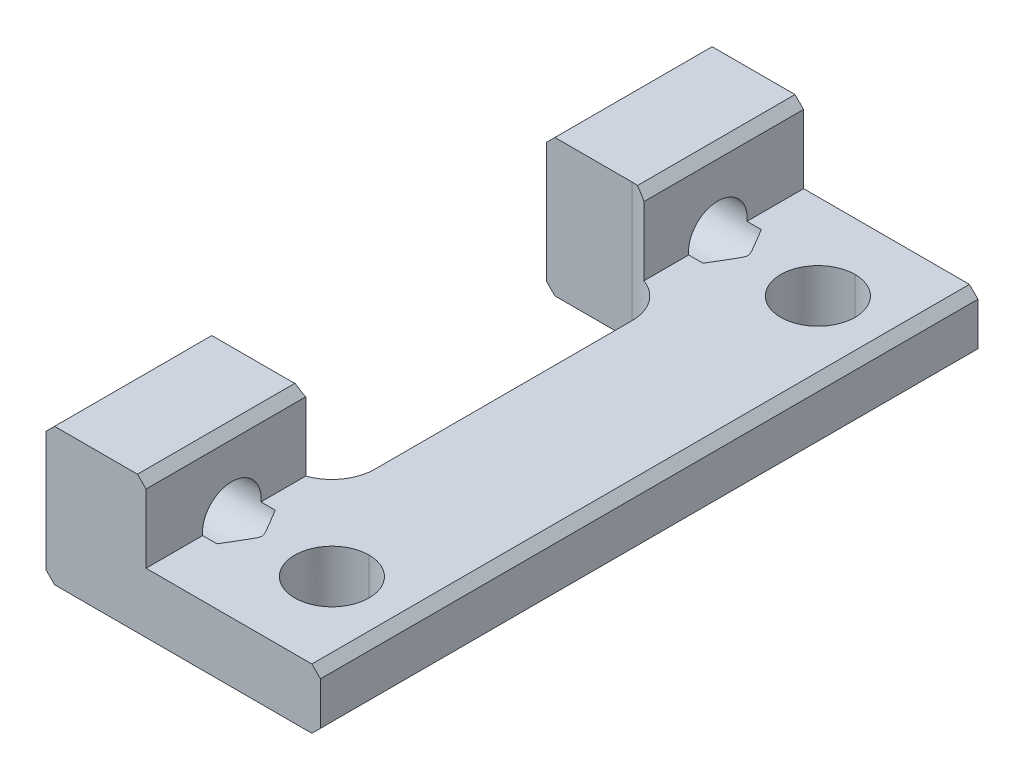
ISO-10303-21;
HEADER;
FILE_DESCRIPTION(('STEP AP214'),'2;1');
FILE_NAME('part.step','',(''),(''),'','','');
FILE_SCHEMA(('AUTOMOTIVE_DESIGN { 1 0 10303 214 1 1 1 1 }'));
ENDSEC;
DATA;
#1=APPLICATION_CONTEXT('core data for automotive mechanical design processes');
#2=APPLICATION_PROTOCOL_DEFINITION('international standard','automotive_design',2000,#1);
#3=PRODUCT_CONTEXT('',#1,'mechanical');
#4=PRODUCT('Part','Part','',(#3));
#5=PRODUCT_RELATED_PRODUCT_CATEGORY('part','',(#4));
#6=PRODUCT_DEFINITION_FORMATION('','',#4);
#7=PRODUCT_DEFINITION_CONTEXT('part definition',#1,'design');
#8=PRODUCT_DEFINITION('design','',#6,#7);
#9=PRODUCT_DEFINITION_SHAPE('','',#8);
#10=(LENGTH_UNIT() NAMED_UNIT(*) SI_UNIT(.MILLI.,.METRE.));
#11=(NAMED_UNIT(*) PLANE_ANGLE_UNIT() SI_UNIT($,.RADIAN.));
#12=(NAMED_UNIT(*) SI_UNIT($,.STERADIAN.) SOLID_ANGLE_UNIT());
#13=UNCERTAINTY_MEASURE_WITH_UNIT(LENGTH_MEASURE(1.E-05),#10,'distance_accuracy_value','');
#14=(GEOMETRIC_REPRESENTATION_CONTEXT(3) GLOBAL_UNCERTAINTY_ASSIGNED_CONTEXT((#13)) GLOBAL_UNIT_ASSIGNED_CONTEXT((#10,
#11,#12)) REPRESENTATION_CONTEXT('',''));
#15=CARTESIAN_POINT('',(0.,0.,0.));
#16=DIRECTION('',(0.,0.,1.));
#17=DIRECTION('',(1.,0.,0.));
#18=AXIS2_PLACEMENT_3D('',#15,#16,#17);
#19=CARTESIAN_POINT('',(-18.175625,55.3,-7.5));
#20=DIRECTION('',(-1.,0.,0.));
#21=DIRECTION('',(0.,0.,1.));
#22=AXIS2_PLACEMENT_3D('',#19,#20,#21);
#23=CYLINDRICAL_SURFACE('',#22,1.025);
#24=DIRECTION('',(-1.,0.,0.));
#25=VECTOR('',#24,1.);
#26=CARTESIAN_POINT('',(-18.175625,55.2,-6.47988971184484));
#27=LINE('',#26,#25);
#28=CARTESIAN_POINT('',(-18.0000000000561,55.2,-6.47988971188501));
#29=VERTEX_POINT('',#28);
#30=CARTESIAN_POINT('',(-18.5,55.2,-6.47988971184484));
#31=VERTEX_POINT('',#30);
#32=EDGE_CURVE('E454',#29,#31,#27,.T.);
#33=ORIENTED_EDGE('',*,*,#32,.F.);
#34=CARTESIAN_POINT('',(-18.0000000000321,55.3000000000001,-7.49999999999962));
#35=DIRECTION('',(-1.,0.,0.));
#36=DIRECTION('',(0.,0.,1.));
#37=AXIS2_PLACEMENT_3D('',#34,#35,#36);
#38=CIRCLE('',#37,1.02499999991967);
#39=CARTESIAN_POINT('',(-18.0000000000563,55.2,-8.52011028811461));
#40=VERTEX_POINT('',#39);
#41=EDGE_CURVE('E368',#29,#40,#38,.F.);
#42=ORIENTED_EDGE('',*,*,#41,.T.);
#43=DIRECTION('',(-1.,0.,0.));
#44=VECTOR('',#43,1.);
#45=CARTESIAN_POINT('',(-18.175625,55.2,-8.52011028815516));
#46=LINE('',#45,#44);
#47=CARTESIAN_POINT('',(-18.5,55.2,-8.52011028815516));
#48=VERTEX_POINT('',#47);
#49=EDGE_CURVE('E456',#48,#40,#46,.F.);
#50=ORIENTED_EDGE('',*,*,#49,.F.);
#51=CARTESIAN_POINT('',(-18.5,55.3,-7.5));
#52=DIRECTION('',(-1.,0.,0.));
#53=DIRECTION('',(0.,0.,1.));
#54=AXIS2_PLACEMENT_3D('',#51,#52,#53);
#55=CIRCLE('',#54,1.025);
#56=EDGE_CURVE('E146',#31,#48,#55,.T.);
#57=ORIENTED_EDGE('',*,*,#56,.F.);
#58=EDGE_LOOP('',(#33,#42,#50,#57));
#59=FACE_BOUND('',#58,.T.);
#60=CARTESIAN_POINT('',(-21.743749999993,55.3,-7.5));
#61=DIRECTION('',(-1.,0.,0.));
#62=DIRECTION('',(0.,0.,1.));
#63=AXIS2_PLACEMENT_3D('',#60,#61,#62);
#64=CIRCLE('',#63,1.02500000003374);
#65=CARTESIAN_POINT('',(-21.743749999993,55.3,-6.47499999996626));
#66=VERTEX_POINT('',#65);
#67=EDGE_CURVE('E451',#66,#66,#64,.T.);
#68=ORIENTED_EDGE('',*,*,#67,.T.);
#69=EDGE_LOOP('',(#68));
#70=FACE_BOUND('',#69,.T.);
#71=ADVANCED_FACE('F17',(#59,#70),#23,.F.);
#72=CARTESIAN_POINT('',(-21.9999999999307,55.3,-7.5));
#73=DIRECTION('',(-1.,0.,0.));
#74=DIRECTION('',(0.,0.,1.));
#75=AXIS2_PLACEMENT_3D('',#72,#73,#74);
#76=CONICAL_SURFACE('',#75,1.28124999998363,0.785398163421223);
#77=CARTESIAN_POINT('',(-21.9999999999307,55.3,-7.5));
#78=DIRECTION('',(-1.,0.,0.));
#79=DIRECTION('',(0.,0.,1.));
#80=AXIS2_PLACEMENT_3D('',#77,#78,#79);
#81=CIRCLE('',#80,1.28124999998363);
#82=CARTESIAN_POINT('',(-21.9999999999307,55.3,-6.21875000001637));
#83=VERTEX_POINT('',#82);
#84=EDGE_CURVE('E328',#83,#83,#81,.F.);
#85=ORIENTED_EDGE('',*,*,#84,.F.);
#86=EDGE_LOOP('',(#85));
#87=FACE_BOUND('',#86,.T.);
#88=ORIENTED_EDGE('',*,*,#67,.F.);
#89=EDGE_LOOP('',(#88));
#90=FACE_BOUND('',#89,.T.);
#91=ADVANCED_FACE('F703',(#87,#90),#76,.F.);
#92=CARTESIAN_POINT('',(-21.7,57.9,-5.));
#93=DIRECTION('',(-0.707106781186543,0.707106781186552,0.));
#94=DIRECTION('',(-0.707106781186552,-0.707106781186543,0.));
#95=AXIS2_PLACEMENT_3D('',#92,#93,#94);
#96=PLANE('',#95);
#97=DIRECTION('',(0.,0.,1.));
#98=VECTOR('',#97,1.);
#99=CARTESIAN_POINT('',(-22.,57.6,-5.));
#100=LINE('',#99,#98);
#101=CARTESIAN_POINT('',(-22.,57.6,-5.));
#102=VERTEX_POINT('',#101);
#103=CARTESIAN_POINT('',(-22.,57.6,-10.5));
#104=VERTEX_POINT('',#103);
#105=EDGE_CURVE('E324',#102,#104,#100,.F.);
#106=ORIENTED_EDGE('',*,*,#105,.F.);
#107=DIRECTION('',(-0.707106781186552,-0.707106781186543,0.));
#108=VECTOR('',#107,1.);
#109=CARTESIAN_POINT('',(-21.7,57.9,-5.));
#110=LINE('',#109,#108);
#111=CARTESIAN_POINT('',(-21.7,57.9,-5.));
#112=VERTEX_POINT('',#111);
#113=EDGE_CURVE('E137',#102,#112,#110,.F.);
#114=ORIENTED_EDGE('',*,*,#113,.T.);
#115=DIRECTION('',(0.,0.,1.));
#116=VECTOR('',#115,1.);
#117=CARTESIAN_POINT('',(-21.7,57.9,-4.95352651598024));
#118=LINE('',#117,#116);
#119=CARTESIAN_POINT('',(-21.7,57.9,-10.5));
#120=VERTEX_POINT('',#119);
#121=EDGE_CURVE('E327',#120,#112,#118,.T.);
#122=ORIENTED_EDGE('',*,*,#121,.F.);
#123=DIRECTION('',(-0.707106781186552,-0.707106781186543,0.));
#124=VECTOR('',#123,1.);
#125=CARTESIAN_POINT('',(-21.7,57.9,-10.5));
#126=LINE('',#125,#124);
#127=EDGE_CURVE('E446',#120,#104,#126,.T.);
#128=ORIENTED_EDGE('',*,*,#127,.T.);
#129=EDGE_LOOP('',(#106,#114,#122,#128));
#130=FACE_BOUND('',#129,.T.);
#131=ADVANCED_FACE('F690',(#130),#96,.T.);
#132=CARTESIAN_POINT('',(-18.5,57.6,-4.88069884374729));
#133=DIRECTION('',(0.707106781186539,0.707106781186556,0.));
#134=DIRECTION('',(-0.707106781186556,0.707106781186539,0.));
#135=AXIS2_PLACEMENT_3D('',#132,#133,#134);
#136=PLANE('',#135);
#137=DIRECTION('',(0.,0.,-1.));
#138=VECTOR('',#137,1.);
#139=CARTESIAN_POINT('',(-18.5,57.6,-4.914213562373));
#140=LINE('',#139,#138);
#141=CARTESIAN_POINT('',(-18.5,57.6,-10.5));
#142=VERTEX_POINT('',#141);
#143=CARTESIAN_POINT('',(-18.5,57.6,-4.91421356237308));
#144=VERTEX_POINT('',#143);
#145=EDGE_CURVE('E131',#142,#144,#140,.F.);
#146=ORIENTED_EDGE('',*,*,#145,.F.);
#147=DIRECTION('',(-0.707106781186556,0.707106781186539,0.));
#148=VECTOR('',#147,1.);
#149=CARTESIAN_POINT('',(-18.5,57.6,-10.5));
#150=LINE('',#149,#148);
#151=CARTESIAN_POINT('',(-18.8,57.9,-10.5));
#152=VERTEX_POINT('',#151);
#153=EDGE_CURVE('E136',#142,#152,#150,.T.);
#154=ORIENTED_EDGE('',*,*,#153,.T.);
#155=DIRECTION('',(0.,0.,1.));
#156=VECTOR('',#155,1.);
#157=CARTESIAN_POINT('',(-18.8,57.9,-4.95352651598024));
#158=LINE('',#157,#156);
#159=CARTESIAN_POINT('',(-18.8,57.9,-4.98660687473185));
#160=VERTEX_POINT('',#159);
#161=EDGE_CURVE('E134',#160,#152,#158,.F.);
#162=ORIENTED_EDGE('',*,*,#161,.F.);
#163=CARTESIAN_POINT('',(-19.,58.1,-3.5));
#164=DIRECTION('',(0.707106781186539,0.707106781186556,0.));
#165=DIRECTION('',(0.707106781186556,-0.707106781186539,0.));
#166=AXIS2_PLACEMENT_3D('',#163,#164,#165);
#167=ELLIPSE('',#166,2.1213203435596,1.5);
#168=EDGE_CURVE('E21',#160,#144,#167,.F.);
#169=ORIENTED_EDGE('',*,*,#168,.T.);
#170=EDGE_LOOP('',(#146,#154,#162,#169));
#171=FACE_BOUND('',#170,.T.);
#172=ADVANCED_FACE('F128',(#171),#136,.T.);
#173=CARTESIAN_POINT('',(-21.9999999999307,55.3,9.5));
#174=DIRECTION('',(-1.,0.,0.));
#175=DIRECTION('',(0.,0.,1.));
#176=AXIS2_PLACEMENT_3D('',#173,#174,#175);
#177=CONICAL_SURFACE('',#176,1.28124999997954,0.785398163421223);
#178=CARTESIAN_POINT('',(-21.9999999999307,55.3,9.5));
#179=DIRECTION('',(-1.,0.,0.));
#180=DIRECTION('',(0.,0.,1.));
#181=AXIS2_PLACEMENT_3D('',#178,#179,#180);
#182=CIRCLE('',#181,1.28124999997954);
#183=CARTESIAN_POINT('',(-21.9999999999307,55.3,10.7812499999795));
#184=VERTEX_POINT('',#183);
#185=EDGE_CURVE('E277',#184,#184,#182,.F.);
#186=ORIENTED_EDGE('',*,*,#185,.F.);
#187=EDGE_LOOP('',(#186));
#188=FACE_BOUND('',#187,.T.);
#189=CARTESIAN_POINT('',(-21.74375,55.3,9.5));
#190=DIRECTION('',(-1.,0.,0.));
#191=DIRECTION('',(0.,0.,1.));
#192=AXIS2_PLACEMENT_3D('',#189,#190,#191);
#193=CIRCLE('',#192,1.025);
#194=CARTESIAN_POINT('',(-21.74375,55.3,10.525));
#195=VERTEX_POINT('',#194);
#196=EDGE_CURVE('E408',#195,#195,#193,.F.);
#197=ORIENTED_EDGE('',*,*,#196,.T.);
#198=EDGE_LOOP('',(#197));
#199=FACE_BOUND('',#198,.T.);
#200=ADVANCED_FACE('F719',(#188,#199),#177,.F.);
#201=CARTESIAN_POINT('',(-21.7,57.9,12.5));
#202=DIRECTION('',(-0.707106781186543,0.707106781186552,0.));
#203=DIRECTION('',(-0.707106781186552,-0.707106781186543,0.));
#204=AXIS2_PLACEMENT_3D('',#201,#202,#203);
#205=PLANE('',#204);
#206=DIRECTION('',(0.,0.,1.));
#207=VECTOR('',#206,1.);
#208=CARTESIAN_POINT('',(-22.,57.6,12.5));
#209=LINE('',#208,#207);
#210=CARTESIAN_POINT('',(-22.,57.6,12.5));
#211=VERTEX_POINT('',#210);
#212=CARTESIAN_POINT('',(-22.,57.6,7.));
#213=VERTEX_POINT('',#212);
#214=EDGE_CURVE('E259',#211,#213,#209,.F.);
#215=ORIENTED_EDGE('',*,*,#214,.F.);
#216=DIRECTION('',(-0.707106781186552,-0.707106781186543,0.));
#217=VECTOR('',#216,1.);
#218=CARTESIAN_POINT('',(-21.7,57.9,12.5));
#219=LINE('',#218,#217);
#220=CARTESIAN_POINT('',(-21.7,57.9,12.5));
#221=VERTEX_POINT('',#220);
#222=EDGE_CURVE('E415',#211,#221,#219,.F.);
#223=ORIENTED_EDGE('',*,*,#222,.T.);
#224=DIRECTION('',(0.,0.,1.));
#225=VECTOR('',#224,1.);
#226=CARTESIAN_POINT('',(-21.7,57.9,12.5));
#227=LINE('',#226,#225);
#228=CARTESIAN_POINT('',(-21.7,57.9,7.));
#229=VERTEX_POINT('',#228);
#230=EDGE_CURVE('E274',#229,#221,#227,.T.);
#231=ORIENTED_EDGE('',*,*,#230,.F.);
#232=DIRECTION('',(-0.707106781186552,-0.707106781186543,0.));
#233=VECTOR('',#232,1.);
#234=CARTESIAN_POINT('',(-21.7,57.9,7.));
#235=LINE('',#234,#233);
#236=EDGE_CURVE('E418',#229,#213,#235,.T.);
#237=ORIENTED_EDGE('',*,*,#236,.T.);
#238=EDGE_LOOP('',(#215,#223,#231,#237));
#239=FACE_BOUND('',#238,.T.);
#240=ADVANCED_FACE('F722',(#239),#205,.T.);
#241=CARTESIAN_POINT('',(-18.5,57.6,12.5));
#242=DIRECTION('',(0.707106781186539,0.707106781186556,0.));
#243=DIRECTION('',(-0.707106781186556,0.707106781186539,0.));
#244=AXIS2_PLACEMENT_3D('',#241,#242,#243);
#245=PLANE('',#244);
#246=DIRECTION('',(0.,0.,1.));
#247=VECTOR('',#246,1.);
#248=CARTESIAN_POINT('',(-18.8,57.9,12.5));
#249=LINE('',#248,#247);
#250=CARTESIAN_POINT('',(-18.8,57.9,12.5));
#251=VERTEX_POINT('',#250);
#252=CARTESIAN_POINT('',(-18.8,57.9,6.98660687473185));
#253=VERTEX_POINT('',#252);
#254=EDGE_CURVE('E317',#251,#253,#249,.F.);
#255=ORIENTED_EDGE('',*,*,#254,.F.);
#256=DIRECTION('',(-0.707106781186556,0.707106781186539,0.));
#257=VECTOR('',#256,1.);
#258=CARTESIAN_POINT('',(-18.5,57.6,12.5));
#259=LINE('',#258,#257);
#260=CARTESIAN_POINT('',(-18.5,57.6,12.5));
#261=VERTEX_POINT('',#260);
#262=EDGE_CURVE('E409',#251,#261,#259,.F.);
#263=ORIENTED_EDGE('',*,*,#262,.T.);
#264=DIRECTION('',(0.,0.,-1.));
#265=VECTOR('',#264,1.);
#266=CARTESIAN_POINT('',(-18.5,57.6,12.5));
#267=LINE('',#266,#265);
#268=CARTESIAN_POINT('',(-18.5,57.6,6.91421356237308));
#269=VERTEX_POINT('',#268);
#270=EDGE_CURVE('E255',#269,#261,#267,.F.);
#271=ORIENTED_EDGE('',*,*,#270,.F.);
#272=CARTESIAN_POINT('',(-19.,58.1,5.5));
#273=DIRECTION('',(0.707106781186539,0.707106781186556,0.));
#274=DIRECTION('',(0.707106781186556,-0.707106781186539,0.));
#275=AXIS2_PLACEMENT_3D('',#272,#273,#274);
#276=ELLIPSE('',#275,2.1213203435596,1.5);
#277=EDGE_CURVE('E412',#269,#253,#276,.F.);
#278=ORIENTED_EDGE('',*,*,#277,.T.);
#279=EDGE_LOOP('',(#255,#263,#271,#278));
#280=FACE_BOUND('',#279,.T.);
#281=ADVANCED_FACE('F608',(#280),#245,.T.);
#282=CARTESIAN_POINT('',(-18.175625,55.3,9.5));
#283=DIRECTION('',(-1.,0.,0.));
#284=DIRECTION('',(0.,0.,1.));
#285=AXIS2_PLACEMENT_3D('',#282,#283,#284);
#286=CYLINDRICAL_SURFACE('',#285,1.025);
#287=DIRECTION('',(-1.,0.,0.));
#288=VECTOR('',#287,1.);
#289=CARTESIAN_POINT('',(-18.175625,55.2,10.5201102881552));
#290=LINE('',#289,#288);
#291=CARTESIAN_POINT('',(-17.9999999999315,55.2,10.5201102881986));
#292=VERTEX_POINT('',#291);
#293=CARTESIAN_POINT('',(-18.5,55.2,10.5201102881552));
#294=VERTEX_POINT('',#293);
#295=EDGE_CURVE('E404',#292,#294,#290,.T.);
#296=ORIENTED_EDGE('',*,*,#295,.F.);
#297=CARTESIAN_POINT('',(-17.9999999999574,55.3000000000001,9.50000000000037));
#298=DIRECTION('',(-1.,0.,0.));
#299=DIRECTION('',(0.,0.,1.));
#300=AXIS2_PLACEMENT_3D('',#297,#298,#299);
#301=CIRCLE('',#300,1.02500000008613);
#302=CARTESIAN_POINT('',(-17.9999999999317,55.2,8.47988971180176));
#303=VERTEX_POINT('',#302);
#304=EDGE_CURVE('E400',#292,#303,#301,.F.);
#305=ORIENTED_EDGE('',*,*,#304,.T.);
#306=DIRECTION('',(-1.,0.,0.));
#307=VECTOR('',#306,1.);
#308=CARTESIAN_POINT('',(-18.175625,55.2,8.47988971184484));
#309=LINE('',#308,#307);
#310=CARTESIAN_POINT('',(-18.5,55.2,8.47988971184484));
#311=VERTEX_POINT('',#310);
#312=EDGE_CURVE('E406',#311,#303,#309,.F.);
#313=ORIENTED_EDGE('',*,*,#312,.F.);
#314=CARTESIAN_POINT('',(-18.5,55.3,9.5));
#315=DIRECTION('',(-1.,0.,0.));
#316=DIRECTION('',(0.,0.,1.));
#317=AXIS2_PLACEMENT_3D('',#314,#315,#316);
#318=CIRCLE('',#317,1.025);
#319=EDGE_CURVE('E258',#294,#311,#318,.T.);
#320=ORIENTED_EDGE('',*,*,#319,.F.);
#321=EDGE_LOOP('',(#296,#305,#313,#320));
#322=FACE_BOUND('',#321,.T.);
#323=ORIENTED_EDGE('',*,*,#196,.F.);
#324=EDGE_LOOP('',(#323));
#325=FACE_BOUND('',#324,.T.);
#326=ADVANCED_FACE('F729',(#322,#325),#286,.F.);
#327=CARTESIAN_POINT('',(-17.9999999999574,55.3000000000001,9.50000000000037));
#328=DIRECTION('',(-1.,0.,0.));
#329=DIRECTION('',(0.,0.,1.));
#330=AXIS2_PLACEMENT_3D('',#327,#328,#329);
#331=CONICAL_SURFACE('',#330,1.02500000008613,1.02974425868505);
#332=CARTESIAN_POINT('',(-17.9999999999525,55.2000000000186,8.47988971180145));
#333=CARTESIAN_POINT('',(-17.9753118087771,55.2000000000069,8.52117340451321));
#334=CARTESIAN_POINT('',(-17.9506345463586,55.2000000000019,8.56246359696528));
#335=CARTESIAN_POINT('',(-17.9013114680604,55.1999999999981,8.64506286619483));
#336=CARTESIAN_POINT('',(-17.8766656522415,55.1999999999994,8.68637194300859));
#337=CARTESIAN_POINT('',(-17.8027150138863,55.2000000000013,8.81046174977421));
#338=CARTESIAN_POINT('',(-17.7534721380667,55.2000000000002,8.89327954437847));
#339=CARTESIAN_POINT('',(-17.6790453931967,55.1999999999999,9.01938493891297));
#340=CARTESIAN_POINT('',(-17.6536644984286,55.2,9.06255593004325));
#341=CARTESIAN_POINT('',(-17.6158732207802,55.2,9.12744586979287));
#342=CARTESIAN_POINT('',(-17.603329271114,55.2,9.14908677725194));
#343=CARTESIAN_POINT('',(-17.5783910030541,55.2,9.19246374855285));
#344=CARTESIAN_POINT('',(-17.5659967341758,55.2,9.2141998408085));
#345=CARTESIAN_POINT('',(-17.5407671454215,55.2,9.25908743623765));
#346=CARTESIAN_POINT('',(-17.5279478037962,55.2,9.28224806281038));
#347=CARTESIAN_POINT('',(-17.5092435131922,55.2,9.3172623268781));
#348=CARTESIAN_POINT('',(-17.5030978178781,55.2,9.32897605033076));
#349=CARTESIAN_POINT('',(-17.4911001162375,55.2,9.35255208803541));
#350=CARTESIAN_POINT('',(-17.4852480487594,55.2,9.36441437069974));
#351=CARTESIAN_POINT('',(-17.4734169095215,55.2,9.38973202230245));
#352=CARTESIAN_POINT('',(-17.4674982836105,55.2,9.4032158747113));
#353=CARTESIAN_POINT('',(-17.4569529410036,55.2,9.43067320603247));
#354=CARTESIAN_POINT('',(-17.452321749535,55.2,9.44464479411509));
#355=CARTESIAN_POINT('',(-17.4467117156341,55.2,9.46932068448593));
#356=CARTESIAN_POINT('',(-17.4450770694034,55.2,9.47986025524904));
#357=CARTESIAN_POINT('',(-17.4438782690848,55.2,9.50102660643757));
#358=CARTESIAN_POINT('',(-17.4443051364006,55.2,9.51165280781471));
#359=CARTESIAN_POINT('',(-17.447558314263,55.2,9.53685305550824));
#360=CARTESIAN_POINT('',(-17.4512807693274,55.2,9.55129566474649));
#361=CARTESIAN_POINT('',(-17.4606023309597,55.2,9.57967857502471));
#362=CARTESIAN_POINT('',(-17.4662254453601,55.2,9.59360978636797));
#363=CARTESIAN_POINT('',(-17.4792614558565,55.2,9.62324005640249));
#364=CARTESIAN_POINT('',(-17.4868167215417,55.2,9.63887528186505));
#365=CARTESIAN_POINT('',(-17.5024589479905,55.2,9.66988025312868));
#366=CARTESIAN_POINT('',(-17.5105462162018,55.2,9.6852498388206));
#367=CARTESIAN_POINT('',(-17.5352332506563,55.2,9.73117922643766));
#368=CARTESIAN_POINT('',(-17.5522387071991,55.2,9.76152001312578));
#369=CARTESIAN_POINT('',(-17.5865253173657,55.2,9.82180915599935));
#370=CARTESIAN_POINT('',(-17.6038043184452,55.2,9.85175876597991));
#371=CARTESIAN_POINT('',(-17.638540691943,55.2,9.91152391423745));
#372=CARTESIAN_POINT('',(-17.6559979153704,55.2,9.94133953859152));
#373=CARTESIAN_POINT('',(-17.7004123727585,55.2,10.0169037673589));
#374=CARTESIAN_POINT('',(-17.7274378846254,55.2,10.0626120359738));
#375=CARTESIAN_POINT('',(-17.7816095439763,55.2,10.1539758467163));
#376=CARTESIAN_POINT('',(-17.8087557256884,55.2,10.1996313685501));
#377=CARTESIAN_POINT('',(-17.8632337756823,55.2,10.2911111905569));
#378=CARTESIAN_POINT('',(-17.8905659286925,55.2,10.3369353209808));
#379=CARTESIAN_POINT('',(-17.9452623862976,55.2,10.4285448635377));
#380=CARTESIAN_POINT('',(-17.9726266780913,55.2,10.4743302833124));
#381=CARTESIAN_POINT('',(-17.999999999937,55.2,10.5201102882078));
#382=B_SPLINE_CURVE_WITH_KNOTS('',3,(#332,#333,#334,#335,#336,#337,#338,#339,#340,#341,#342,
#343,#344,#345,#346,#347,#348,#349,#350,#351,#352,#353,#354,#355,#356,#357,#358,#359,#360,#361,
#362,#363,#364,#365,#366,#367,#368,#369,#370,#371,#372,#373,#374,#375,#376,#377,#378,#379,#380,
#381),.UNSPECIFIED.,.F.,.F.,(4,2,2,2,2,2,2,2,2,2,2,2,2,2,2,2,2,2,2,2,2,2,2,2,4),(0.,
0.144307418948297,0.288615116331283,0.577669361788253,0.727906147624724,0.802946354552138,
0.878010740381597,0.957418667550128,0.997100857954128,1.03677474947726,1.08093418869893,
1.12493816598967,1.15677527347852,1.18847384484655,1.23292374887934,1.2779575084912,
1.33002678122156,1.38212641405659,1.48645818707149,1.59018893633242,1.69383910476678,
1.8531393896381,2.01248818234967,2.17255714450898,2.33257581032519),.UNSPECIFIED.);
#383=EDGE_CURVE('E388',#303,#292,#382,.T.);
#384=ORIENTED_EDGE('',*,*,#383,.F.);
#385=ORIENTED_EDGE('',*,*,#304,.F.);
#386=EDGE_LOOP('',(#384,#385));
#387=FACE_BOUND('',#386,.T.);
#388=ADVANCED_FACE('F731',(#387),#331,.F.);
#389=CARTESIAN_POINT('',(-12.4,54.9,12.5));
#390=DIRECTION('',(0.70710678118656,0.707106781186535,0.));
#391=DIRECTION('',(-0.707106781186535,0.70710678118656,0.));
#392=AXIS2_PLACEMENT_3D('',#389,#390,#391);
#393=PLANE('',#392);
#394=DIRECTION('',(0.,0.,1.));
#395=VECTOR('',#394,1.);
#396=CARTESIAN_POINT('',(-12.7,55.2,12.5));
#397=LINE('',#396,#395);
#398=CARTESIAN_POINT('',(-12.7,55.2,12.5));
#399=VERTEX_POINT('',#398);
#400=CARTESIAN_POINT('',(-12.7,55.2,-10.5));
#401=VERTEX_POINT('',#400);
#402=EDGE_CURVE('E375',#399,#401,#397,.F.);
#403=ORIENTED_EDGE('',*,*,#402,.F.);
#404=DIRECTION('',(-0.707106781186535,0.70710678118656,0.));
#405=VECTOR('',#404,1.);
#406=CARTESIAN_POINT('',(-12.4,54.9,12.5));
#407=LINE('',#406,#405);
#408=CARTESIAN_POINT('',(-12.4,54.9,12.5));
#409=VERTEX_POINT('',#408);
#410=EDGE_CURVE('E371',#399,#409,#407,.F.);
#411=ORIENTED_EDGE('',*,*,#410,.T.);
#412=DIRECTION('',(0.,0.,-1.));
#413=VECTOR('',#412,1.);
#414=CARTESIAN_POINT('',(-12.4,54.9,12.5));
#415=LINE('',#414,#413);
#416=CARTESIAN_POINT('',(-12.4,54.9,-10.5));
#417=VERTEX_POINT('',#416);
#418=EDGE_CURVE('E298',#417,#409,#415,.F.);
#419=ORIENTED_EDGE('',*,*,#418,.F.);
#420=DIRECTION('',(-0.707106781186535,0.70710678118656,0.));
#421=VECTOR('',#420,1.);
#422=CARTESIAN_POINT('',(-12.4,54.9,-10.5));
#423=LINE('',#422,#421);
#424=EDGE_CURVE('E403',#417,#401,#423,.T.);
#425=ORIENTED_EDGE('',*,*,#424,.T.);
#426=EDGE_LOOP('',(#403,#411,#419,#425));
#427=FACE_BOUND('',#426,.T.);
#428=ADVANCED_FACE('F735',(#427),#393,.T.);
#429=CARTESIAN_POINT('',(-18.0000000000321,55.3000000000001,-7.49999999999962));
#430=DIRECTION('',(-1.,0.,0.));
#431=DIRECTION('',(0.,0.,1.));
#432=AXIS2_PLACEMENT_3D('',#429,#430,#431);
#433=CONICAL_SURFACE('',#432,1.02499999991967,1.02974425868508);
#434=CARTESIAN_POINT('',(-18.0000000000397,55.1999999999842,-8.52011028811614));
#435=CARTESIAN_POINT('',(-17.9753118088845,55.1999999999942,-8.47882659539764));
#436=CARTESIAN_POINT('',(-17.9506345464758,55.1999999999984,-8.43753640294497));
#437=CARTESIAN_POINT('',(-17.901311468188,55.2000000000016,-8.35493713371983));
#438=CARTESIAN_POINT('',(-17.8766656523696,55.2000000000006,-8.31362805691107));
#439=CARTESIAN_POINT('',(-17.8027150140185,55.1999999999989,-8.1895382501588));
#440=CARTESIAN_POINT('',(-17.7534721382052,55.1999999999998,-8.1067204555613));
#441=CARTESIAN_POINT('',(-17.679045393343,55.2000000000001,-7.98061506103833));
#442=CARTESIAN_POINT('',(-17.6536644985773,55.2,-7.93744406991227));
#443=CARTESIAN_POINT('',(-17.6158732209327,55.2,-7.87255413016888));
#444=CARTESIAN_POINT('',(-17.6033292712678,55.2,-7.85091322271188));
#445=CARTESIAN_POINT('',(-17.5783910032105,55.2,-7.8075362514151));
#446=CARTESIAN_POINT('',(-17.5659967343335,55.2,-7.78580015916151));
#447=CARTESIAN_POINT('',(-17.5407671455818,55.2,-7.74091256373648));
#448=CARTESIAN_POINT('',(-17.5279478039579,55.2,-7.71775193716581));
#449=CARTESIAN_POINT('',(-17.5092435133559,55.2,-7.68273767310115));
#450=CARTESIAN_POINT('',(-17.5030978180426,55.2,-7.6710239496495));
#451=CARTESIAN_POINT('',(-17.4911001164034,55.2,-7.64744791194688));
#452=CARTESIAN_POINT('',(-17.4852480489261,55.2,-7.63558562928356));
#453=CARTESIAN_POINT('',(-17.4734169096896,55.2,-7.61026797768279));
#454=CARTESIAN_POINT('',(-17.4674982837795,55.2,-7.59678412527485));
#455=CARTESIAN_POINT('',(-17.4569529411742,55.2,-7.56932679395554));
#456=CARTESIAN_POINT('',(-17.4523217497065,55.2,-7.55535520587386));
#457=CARTESIAN_POINT('',(-17.4467117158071,55.2,-7.53067931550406));
#458=CARTESIAN_POINT('',(-17.4450770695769,55.2,-7.52013974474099));
#459=CARTESIAN_POINT('',(-17.4438782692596,55.2,-7.49897339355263));
#460=CARTESIAN_POINT('',(-17.444305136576,55.2,-7.48834719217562));
#461=CARTESIAN_POINT('',(-17.4475583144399,55.2,-7.46314694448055));
#462=CARTESIAN_POINT('',(-17.4512807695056,55.2,-7.44870433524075));
#463=CARTESIAN_POINT('',(-17.4606023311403,55.2,-7.42032142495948));
#464=CARTESIAN_POINT('',(-17.4662254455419,55.2,-7.40639021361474));
#465=CARTESIAN_POINT('',(-17.4792614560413,55.2,-7.37675994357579));
#466=CARTESIAN_POINT('',(-17.4868167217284,55.2,-7.36112471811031));
#467=CARTESIAN_POINT('',(-17.5024589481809,55.2,-7.33011974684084));
#468=CARTESIAN_POINT('',(-17.5105462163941,55.2,-7.31475016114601));
#469=CARTESIAN_POINT('',(-17.5352332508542,55.2,-7.2688207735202));
#470=CARTESIAN_POINT('',(-17.5522387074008,55.2,-7.23847998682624));
#471=CARTESIAN_POINT('',(-17.5865253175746,55.2,-7.17819084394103));
#472=CARTESIAN_POINT('',(-17.6038043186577,55.2,-7.14824123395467));
#473=CARTESIAN_POINT('',(-17.6385406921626,55.2,-7.08847608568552));
#474=CARTESIAN_POINT('',(-17.6559979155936,55.2,-7.05866046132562));
#475=CARTESIAN_POINT('',(-17.7004123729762,55.2,-6.98309623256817));
#476=CARTESIAN_POINT('',(-17.727437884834,55.2,-6.937387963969));
#477=CARTESIAN_POINT('',(-17.7816095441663,55.2,-6.84602415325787));
#478=CARTESIAN_POINT('',(-17.8087557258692,55.2,-6.80036863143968));
#479=CARTESIAN_POINT('',(-17.8632337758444,55.2,-6.7088888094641));
#480=CARTESIAN_POINT('',(-17.8905659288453,55.2,-6.66306467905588));
#481=CARTESIAN_POINT('',(-17.9452623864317,55.2,-6.57145513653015));
#482=CARTESIAN_POINT('',(-17.9726266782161,55.2,-6.52566971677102));
#483=CARTESIAN_POINT('',(-18.0000000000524,55.2,-6.47988971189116));
#484=B_SPLINE_CURVE_WITH_KNOTS('',3,(#434,#435,#436,#437,#438,#439,#440,#441,#442,#443,#444,
#445,#446,#447,#448,#449,#450,#451,#452,#453,#454,#455,#456,#457,#458,#459,#460,#461,#462,#463,
#464,#465,#466,#467,#468,#469,#470,#471,#472,#473,#474,#475,#476,#477,#478,#479,#480,#481,#482,
#483),.UNSPECIFIED.,.F.,.F.,(4,2,2,2,2,2,2,2,2,2,2,2,2,2,2,2,2,2,2,2,2,2,2,2,4),(0.,
0.144307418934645,0.288615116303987,0.577669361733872,0.727906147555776,0.802946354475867,
0.878010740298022,0.957418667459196,0.997100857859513,1.03677474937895,1.08093418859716,
1.12493816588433,1.15677527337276,1.1884738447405,1.23292374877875,1.27795750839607,
1.33002678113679,1.38212641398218,1.48645818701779,1.59018893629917,1.69383910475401,
1.85313938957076,2.01248818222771,2.17255714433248,2.33257581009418),.UNSPECIFIED.);
#485=EDGE_CURVE('E356',#40,#29,#484,.T.);
#486=ORIENTED_EDGE('',*,*,#485,.F.);
#487=ORIENTED_EDGE('',*,*,#41,.F.);
#488=EDGE_LOOP('',(#486,#487));
#489=FACE_BOUND('',#488,.T.);
#490=ADVANCED_FACE('F485',(#489),#433,.F.);
#491=CARTESIAN_POINT('',(-15.,53.11,9.49999999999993));
#492=DIRECTION('',(0.,1.,0.));
#493=DIRECTION('',(0.,0.,1.));
#494=AXIS2_PLACEMENT_3D('',#491,#492,#493);
#495=CYLINDRICAL_SURFACE('',#494,1.30000000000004);
#496=CARTESIAN_POINT('',(-15.,53.3000000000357,9.50000000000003));
#497=DIRECTION('',(0.,-1.,0.));
#498=DIRECTION('',(0.,0.,-1.));
#499=AXIS2_PLACEMENT_3D('',#496,#497,#498);
#500=CIRCLE('',#499,1.30000000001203);
#501=CARTESIAN_POINT('',(-15.,53.3000000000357,8.199999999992));
#502=VERTEX_POINT('',#501);
#503=CARTESIAN_POINT('',(-15.0000000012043,53.3000000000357,10.800000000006));
#504=VERTEX_POINT('',#503);
#505=EDGE_CURVE('E354',#502,#504,#500,.T.);
#506=ORIENTED_EDGE('',*,*,#505,.T.);
#507=DIRECTION('',(0.,1.,0.));
#508=VECTOR('',#507,1.);
#509=CARTESIAN_POINT('',(-15.,53.11,10.8));
#510=LINE('',#509,#508);
#511=CARTESIAN_POINT('',(-15.000000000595,55.2,10.8));
#512=VERTEX_POINT('',#511);
#513=EDGE_CURVE('E365',#512,#504,#510,.F.);
#514=ORIENTED_EDGE('',*,*,#513,.F.);
#515=CARTESIAN_POINT('',(-15.,55.2,9.49999999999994));
#516=DIRECTION('',(0.,1.,0.));
#517=DIRECTION('',(0.,0.,1.));
#518=AXIS2_PLACEMENT_3D('',#515,#516,#517);
#519=CIRCLE('',#518,1.30000000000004);
#520=CARTESIAN_POINT('',(-15.,55.2,8.19999999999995));
#521=VERTEX_POINT('',#520);
#522=EDGE_CURVE('E517',#521,#512,#519,.F.);
#523=ORIENTED_EDGE('',*,*,#522,.F.);
#524=DIRECTION('',(0.,1.,0.));
#525=VECTOR('',#524,1.);
#526=CARTESIAN_POINT('',(-15.,54.25,8.2));
#527=LINE('',#526,#525);
#528=EDGE_CURVE('E363',#502,#521,#527,.T.);
#529=ORIENTED_EDGE('',*,*,#528,.F.);
#530=EDGE_LOOP('',(#506,#514,#523,#529));
#531=FACE_BOUND('',#530,.T.);
#532=ADVANCED_FACE('F526',(#531),#495,.F.);
#533=CARTESIAN_POINT('',(-15.,53.11,8.2));
#534=CARTESIAN_POINT('',(-17.599999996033,53.11,8.2));
#535=CARTESIAN_POINT('',(-17.5999999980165,53.11,10.799999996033));
#536=CARTESIAN_POINT('',(-15.0000000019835,53.11,10.8));
#537=CARTESIAN_POINT('',(-15.,55.39,8.2));
#538=CARTESIAN_POINT('',(-17.599999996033,55.39,8.2));
#539=CARTESIAN_POINT('',(-17.5999999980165,55.39,10.799999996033));
#540=CARTESIAN_POINT('',(-15.0000000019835,55.39,10.8));
#541=(BOUNDED_SURFACE() B_SPLINE_SURFACE(1,3,((#533,#534,#535,#536),(#537,#538,#539,#540)),
.UNSPECIFIED.,.F.,.F.,.F.) B_SPLINE_SURFACE_WITH_KNOTS((2,2),(4,4),(0.,1.),(0.,1.),
.UNSPECIFIED.) GEOMETRIC_REPRESENTATION_ITEM() RATIONAL_B_SPLINE_SURFACE(((1.,0.333333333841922,
0.333333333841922,1.),(1.,0.333333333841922,0.333333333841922,1.))) REPRESENTATION_ITEM('') SURFACE());
#542=CARTESIAN_POINT('',(-15.0000000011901,55.2,10.8));
#543=CARTESIAN_POINT('',(-15.0365743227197,55.2,10.8000003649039));
#544=CARTESIAN_POINT('',(-15.0731324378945,55.2,10.7984557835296));
#545=CARTESIAN_POINT('',(-15.1459851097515,55.2,10.7922945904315));
#546=CARTESIAN_POINT('',(-15.1822796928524,55.2,10.787678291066));
#547=CARTESIAN_POINT('',(-15.2903194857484,55.2,10.7692674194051));
#548=CARTESIAN_POINT('',(-15.361336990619,55.2,10.7509107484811));
#549=CARTESIAN_POINT('',(-15.4993095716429,55.2,10.7025128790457));
#550=CARTESIAN_POINT('',(-15.5662627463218,55.2,10.6724662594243));
#551=CARTESIAN_POINT('',(-15.6621258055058,55.2,10.6193426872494));
#552=CARTESIAN_POINT('',(-15.6933221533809,55.2,10.6002900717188));
#553=CARTESIAN_POINT('',(-15.7540314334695,55.2,10.5596098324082));
#554=CARTESIAN_POINT('',(-15.7835427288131,55.2,10.5379797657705));
#555=CARTESIAN_POINT('',(-15.8691440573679,55.2,10.4694937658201));
#556=CARTESIAN_POINT('',(-15.9223836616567,55.2,10.418996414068));
#557=CARTESIAN_POINT('',(-16.019616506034,55.2,10.3097705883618));
#558=CARTESIAN_POINT('',(-16.0636097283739,55.2,10.2510420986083));
#559=CARTESIAN_POINT('',(-16.1217260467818,55.2,10.1580821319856));
#560=CARTESIAN_POINT('',(-16.1397957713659,55.2,10.1262603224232));
#561=CARTESIAN_POINT('',(-16.1731766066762,55.2,10.0612407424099));
#562=CARTESIAN_POINT('',(-16.1884903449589,55.2,10.0280443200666));
#563=CARTESIAN_POINT('',(-16.2301525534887,55.2,9.92667559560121));
#564=CARTESIAN_POINT('',(-16.2522405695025,55.2,9.85669409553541));
#565=CARTESIAN_POINT('',(-16.2843418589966,55.2,9.7140506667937));
#566=CARTESIAN_POINT('',(-16.2943548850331,55.2,9.64138868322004));
#567=CARTESIAN_POINT('',(-16.3020441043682,55.2,9.4954041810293));
#568=CARTESIAN_POINT('',(-16.2997200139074,55.2,9.42208164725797));
#569=CARTESIAN_POINT('',(-16.2827921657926,55.2,9.2768687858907));
#570=CARTESIAN_POINT('',(-16.2681885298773,55.2,9.20497844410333));
#571=CARTESIAN_POINT('',(-16.2271264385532,55.2,9.06467697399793));
#572=CARTESIAN_POINT('',(-16.2006680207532,55.2,8.99626583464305));
#573=CARTESIAN_POINT('',(-16.1366145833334,55.2,8.86482678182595));
#574=CARTESIAN_POINT('',(-16.0990192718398,55.2,8.80179900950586));
#575=CARTESIAN_POINT('',(-16.0351554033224,55.2,8.7127305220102));
#576=CARTESIAN_POINT('',(-16.0126175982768,55.2,8.68394856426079));
#577=CARTESIAN_POINT('',(-15.9651785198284,55.2,8.62835403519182));
#578=CARTESIAN_POINT('',(-15.9402749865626,55.2,8.60154339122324));
#579=CARTESIAN_POINT('',(-15.8623347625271,55.2,8.52444439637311));
#580=CARTESIAN_POINT('',(-15.8060110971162,55.2,8.47740916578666));
#581=CARTESIAN_POINT('',(-15.686261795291,55.2,8.3934779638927));
#582=CARTESIAN_POINT('',(-15.6228364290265,55.2,8.35658160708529));
#583=CARTESIAN_POINT('',(-15.5237502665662,55.2,8.30960998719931));
#584=CARTESIAN_POINT('',(-15.4900264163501,55.2,8.29533780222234));
#585=CARTESIAN_POINT('',(-15.4215302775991,55.2,8.26969517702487));
#586=CARTESIAN_POINT('',(-15.3867588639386,55.2,8.25832238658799));
#587=CARTESIAN_POINT('',(-15.2812506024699,55.2,8.22869626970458));
#588=CARTESIAN_POINT('',(-15.2091849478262,55.2000000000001,8.21487143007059));
#589=CARTESIAN_POINT('',(-15.1138905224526,55.2,8.2047954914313));
#590=CARTESIAN_POINT('',(-15.0911301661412,55.2,8.20299631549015));
#591=CARTESIAN_POINT('',(-15.0455839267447,55.2,8.20060054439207));
#592=CARTESIAN_POINT('',(-15.0227981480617,55.2,8.20000196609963));
#593=CARTESIAN_POINT('',(-15.,55.2,8.2));
#594=B_SPLINE_CURVE_WITH_KNOTS('',3,(#542,#543,#544,#545,#546,#547,#548,#549,#550,#551,#552,
#553,#554,#555,#556,#557,#558,#559,#560,#561,#562,#563,#564,#565,#566,#567,#568,#569,#570,#571,
#572,#573,#574,#575,#576,#577,#578,#579,#580,#581,#582,#583,#584,#585,#586,#587,#588,#589,#590,
#591,#592,#593),.UNSPECIFIED.,.F.,.F.,(4,2,2,2,2,2,2,2,2,2,2,2,2,2,2,2,2,2,2,2,2,2,2,2,2,4),(0.,
0.109658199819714,0.21930525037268,0.438255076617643,0.657306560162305,0.766855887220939,
0.876509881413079,1.09553964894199,1.31456983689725,1.42423835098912,1.53380174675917,
1.75282471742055,1.97185217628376,2.19088467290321,2.40991499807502,2.62894462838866,
2.84797999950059,2.95753687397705,3.06719947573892,3.2862336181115,3.50525943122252,
3.61500069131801,3.72465271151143,3.94351474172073,4.01198978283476,4.08035162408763),.UNSPECIFIED.);
#595=EDGE_CURVE('E510',#512,#521,#594,.T.);
#596=CARTESIAN_POINT('',(-15.,53.3000000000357,9.50000000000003));
#597=DIRECTION('',(0.,-1.,0.));
#598=DIRECTION('',(0.,0.,-1.));
#599=AXIS2_PLACEMENT_3D('',#596,#597,#598);
#600=CIRCLE('',#599,1.30000000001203);
#601=EDGE_CURVE('E343',#504,#502,#600,.T.);
#602=ORIENTED_EDGE('',*,*,#528,.T.);
#603=ORIENTED_EDGE('',*,*,#595,.F.);
#604=ORIENTED_EDGE('',*,*,#513,.T.);
#605=ORIENTED_EDGE('',*,*,#601,.T.);
#606=EDGE_LOOP('',(#602,#603,#604,#605));
#607=FACE_BOUND('',#606,.T.);
#608=ADVANCED_FACE('F519',(#607),#541,.T.);
#609=CARTESIAN_POINT('',(-15.,53.11,-7.50000000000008));
#610=DIRECTION('',(0.,1.,0.));
#611=DIRECTION('',(0.,0.,1.));
#612=AXIS2_PLACEMENT_3D('',#609,#610,#611);
#613=CYLINDRICAL_SURFACE('',#612,1.30000000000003);
#614=CARTESIAN_POINT('',(-15.,53.3000000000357,-7.49999999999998));
#615=DIRECTION('',(0.,-1.,0.));
#616=DIRECTION('',(0.,0.,-1.));
#617=AXIS2_PLACEMENT_3D('',#614,#615,#616);
#618=CIRCLE('',#617,1.30000000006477);
#619=CARTESIAN_POINT('',(-15.,53.3000000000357,-8.80000000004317));
#620=VERTEX_POINT('',#619);
#621=CARTESIAN_POINT('',(-15.0000000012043,53.3000000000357,-6.19999999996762));
#622=VERTEX_POINT('',#621);
#623=EDGE_CURVE('E341',#620,#622,#618,.T.);
#624=ORIENTED_EDGE('',*,*,#623,.T.);
#625=DIRECTION('',(0.,1.,0.));
#626=VECTOR('',#625,1.);
#627=CARTESIAN_POINT('',(-15.,53.11,-6.20000000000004));
#628=LINE('',#627,#626);
#629=CARTESIAN_POINT('',(-15.000000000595,55.2,-6.20000000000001));
#630=VERTEX_POINT('',#629);
#631=EDGE_CURVE('E351',#630,#622,#628,.F.);
#632=ORIENTED_EDGE('',*,*,#631,.F.);
#633=CARTESIAN_POINT('',(-15.,55.2,-7.50000000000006));
#634=DIRECTION('',(0.,1.,0.));
#635=DIRECTION('',(0.,0.,1.));
#636=AXIS2_PLACEMENT_3D('',#633,#634,#635);
#637=CIRCLE('',#636,1.30000000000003);
#638=CARTESIAN_POINT('',(-15.,55.2,-8.80000000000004));
#639=VERTEX_POINT('',#638);
#640=EDGE_CURVE('E625',#639,#630,#637,.F.);
#641=ORIENTED_EDGE('',*,*,#640,.F.);
#642=DIRECTION('',(0.,1.,0.));
#643=VECTOR('',#642,1.);
#644=CARTESIAN_POINT('',(-15.,54.25,-8.8));
#645=LINE('',#644,#643);
#646=EDGE_CURVE('E147',#620,#639,#645,.T.);
#647=ORIENTED_EDGE('',*,*,#646,.F.);
#648=EDGE_LOOP('',(#624,#632,#641,#647));
#649=FACE_BOUND('',#648,.T.);
#650=ADVANCED_FACE('F525',(#649),#613,.F.);
#651=CARTESIAN_POINT('',(-15.,53.11,-8.8));
#652=CARTESIAN_POINT('',(-17.599999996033,53.11,-8.8));
#653=CARTESIAN_POINT('',(-17.5999999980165,53.11,-6.200000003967));
#654=CARTESIAN_POINT('',(-15.0000000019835,53.11,-6.2));
#655=CARTESIAN_POINT('',(-15.,55.39,-8.8));
#656=CARTESIAN_POINT('',(-17.599999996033,55.39,-8.8));
#657=CARTESIAN_POINT('',(-17.5999999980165,55.39,-6.200000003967));
#658=CARTESIAN_POINT('',(-15.0000000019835,55.39,-6.2));
#659=(BOUNDED_SURFACE() B_SPLINE_SURFACE(1,3,((#651,#652,#653,#654),(#655,#656,#657,#658)),
.UNSPECIFIED.,.F.,.F.,.F.) B_SPLINE_SURFACE_WITH_KNOTS((2,2),(4,4),(0.,1.),(0.,1.),
.UNSPECIFIED.) GEOMETRIC_REPRESENTATION_ITEM() RATIONAL_B_SPLINE_SURFACE(((1.,0.333333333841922,
0.333333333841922,1.),(1.,0.333333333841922,0.333333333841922,1.))) REPRESENTATION_ITEM('') SURFACE());
#660=CARTESIAN_POINT('',(-15.0000000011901,55.2,-6.2));
#661=CARTESIAN_POINT('',(-15.0365743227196,55.2,-6.19999963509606));
#662=CARTESIAN_POINT('',(-15.0731324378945,55.2,-6.20154421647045));
#663=CARTESIAN_POINT('',(-15.1459851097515,55.2,-6.20770540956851));
#664=CARTESIAN_POINT('',(-15.1822796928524,55.2,-6.212321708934));
#665=CARTESIAN_POINT('',(-15.2903194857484,55.2,-6.23073258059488));
#666=CARTESIAN_POINT('',(-15.361336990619,55.2,-6.24908925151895));
#667=CARTESIAN_POINT('',(-15.4993095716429,55.2,-6.29748712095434));
#668=CARTESIAN_POINT('',(-15.5662627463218,55.2,-6.32753374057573));
#669=CARTESIAN_POINT('',(-15.6621258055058,55.2,-6.38065731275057));
#670=CARTESIAN_POINT('',(-15.6933221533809,55.2,-6.39970992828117));
#671=CARTESIAN_POINT('',(-15.7540314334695,55.2,-6.44039016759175));
#672=CARTESIAN_POINT('',(-15.783542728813,55.2,-6.46202023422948));
#673=CARTESIAN_POINT('',(-15.8691440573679,55.2,-6.53050623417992));
#674=CARTESIAN_POINT('',(-15.9223836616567,55.2,-6.58100358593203));
#675=CARTESIAN_POINT('',(-16.019616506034,55.2,-6.69022941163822));
#676=CARTESIAN_POINT('',(-16.0636097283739,55.2,-6.7489579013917));
#677=CARTESIAN_POINT('',(-16.1217260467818,55.2,-6.84191786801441));
#678=CARTESIAN_POINT('',(-16.1397957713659,55.2,-6.87373967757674));
#679=CARTESIAN_POINT('',(-16.1731766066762,55.2,-6.93875925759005));
#680=CARTESIAN_POINT('',(-16.1884903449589,55.2,-6.97195567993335));
#681=CARTESIAN_POINT('',(-16.2301525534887,55.2,-7.07332440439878));
#682=CARTESIAN_POINT('',(-16.2522405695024,55.2,-7.14330590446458));
#683=CARTESIAN_POINT('',(-16.2843418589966,55.2,-7.28594933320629));
#684=CARTESIAN_POINT('',(-16.2943548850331,55.2,-7.35861131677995));
#685=CARTESIAN_POINT('',(-16.3020441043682,55.2,-7.50459581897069));
#686=CARTESIAN_POINT('',(-16.2997200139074,55.2,-7.57791835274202));
#687=CARTESIAN_POINT('',(-16.2827921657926,55.2,-7.7231312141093));
#688=CARTESIAN_POINT('',(-16.2681885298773,55.2,-7.79502155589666));
#689=CARTESIAN_POINT('',(-16.2271264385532,55.2,-7.93532302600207));
#690=CARTESIAN_POINT('',(-16.2006680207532,55.2,-8.00373416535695));
#691=CARTESIAN_POINT('',(-16.1366145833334,55.2,-8.13517321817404));
#692=CARTESIAN_POINT('',(-16.0990192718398,55.2,-8.19820099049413));
#693=CARTESIAN_POINT('',(-16.0351554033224,55.2,-8.2872694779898));
#694=CARTESIAN_POINT('',(-16.0126175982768,55.2,-8.3160514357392));
#695=CARTESIAN_POINT('',(-15.9651785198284,55.2,-8.37164596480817));
#696=CARTESIAN_POINT('',(-15.9402749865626,55.2,-8.39845660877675));
#697=CARTESIAN_POINT('',(-15.8623347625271,55.2,-8.47555560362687));
#698=CARTESIAN_POINT('',(-15.8060110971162,55.2,-8.52259083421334));
#699=CARTESIAN_POINT('',(-15.686261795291,55.2,-8.6065220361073));
#700=CARTESIAN_POINT('',(-15.6228364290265,55.2,-8.64341839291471));
#701=CARTESIAN_POINT('',(-15.5237502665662,55.2,-8.69039001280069));
#702=CARTESIAN_POINT('',(-15.4900264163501,55.2,-8.70466219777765));
#703=CARTESIAN_POINT('',(-15.4215302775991,55.2,-8.73030482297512));
#704=CARTESIAN_POINT('',(-15.3867588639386,55.2,-8.74167761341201));
#705=CARTESIAN_POINT('',(-15.2812506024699,55.2,-8.77130373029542));
#706=CARTESIAN_POINT('',(-15.2091849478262,55.2,-8.78512856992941));
#707=CARTESIAN_POINT('',(-15.1138905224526,55.2,-8.7952045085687));
#708=CARTESIAN_POINT('',(-15.0911301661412,55.2,-8.79700368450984));
#709=CARTESIAN_POINT('',(-15.0455839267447,55.2,-8.79939945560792));
#710=CARTESIAN_POINT('',(-15.0227981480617,55.2,-8.79999803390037));
#711=CARTESIAN_POINT('',(-15.,55.2,-8.8));
#712=B_SPLINE_CURVE_WITH_KNOTS('',3,(#660,#661,#662,#663,#664,#665,#666,#667,#668,#669,#670,
#671,#672,#673,#674,#675,#676,#677,#678,#679,#680,#681,#682,#683,#684,#685,#686,#687,#688,#689,
#690,#691,#692,#693,#694,#695,#696,#697,#698,#699,#700,#701,#702,#703,#704,#705,#706,#707,#708,
#709,#710,#711),.UNSPECIFIED.,.F.,.F.,(4,2,2,2,2,2,2,2,2,2,2,2,2,2,2,2,2,2,2,2,2,2,2,2,2,4),(0.,
0.109658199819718,0.219305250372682,0.438255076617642,0.6573065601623,0.76685588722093,
0.876509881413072,1.09553964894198,1.31456983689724,1.42423835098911,1.53380174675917,
1.75282471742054,1.97185217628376,2.1908846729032,2.40991499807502,2.62894462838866,
2.84797999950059,2.95753687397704,3.06719947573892,3.2862336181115,3.50525943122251,
3.615000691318,3.72465271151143,3.94351474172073,4.01198978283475,4.08035162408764),.UNSPECIFIED.);
#713=EDGE_CURVE('E502',#630,#639,#712,.T.);
#714=CARTESIAN_POINT('',(-15.,53.3000000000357,-7.49999999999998));
#715=DIRECTION('',(0.,-1.,0.));
#716=DIRECTION('',(0.,0.,-1.));
#717=AXIS2_PLACEMENT_3D('',#714,#715,#716);
#718=CIRCLE('',#717,1.30000000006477);
#719=EDGE_CURVE('E157',#622,#620,#718,.T.);
#720=ORIENTED_EDGE('',*,*,#646,.T.);
#721=ORIENTED_EDGE('',*,*,#713,.F.);
#722=ORIENTED_EDGE('',*,*,#631,.T.);
#723=ORIENTED_EDGE('',*,*,#719,.T.);
#724=EDGE_LOOP('',(#720,#721,#722,#723));
#725=FACE_BOUND('',#724,.T.);
#726=ADVANCED_FACE('F534',(#725),#659,.T.);
#727=CARTESIAN_POINT('',(-18.5,57.6,-4.914213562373));
#728=DIRECTION('',(1.,0.,0.));
#729=DIRECTION('',(0.,0.,-1.));
#730=AXIS2_PLACEMENT_3D('',#727,#728,#729);
#731=PLANE('',#730);
#732=DIRECTION('',(0.,0.,1.));
#733=VECTOR('',#732,1.);
#734=CARTESIAN_POINT('',(-18.5,55.2,12.5));
#735=LINE('',#734,#733);
#736=CARTESIAN_POINT('',(-18.5,55.2,-10.5));
#737=VERTEX_POINT('',#736);
#738=EDGE_CURVE('E372',#737,#48,#735,.T.);
#739=ORIENTED_EDGE('',*,*,#738,.F.);
#740=DIRECTION('',(0.,1.,0.));
#741=VECTOR('',#740,1.);
#742=CARTESIAN_POINT('',(-18.5,53.1,-10.5));
#743=LINE('',#742,#741);
#744=EDGE_CURVE('E145',#142,#737,#743,.F.);
#745=ORIENTED_EDGE('',*,*,#744,.F.);
#746=ORIENTED_EDGE('',*,*,#145,.T.);
#747=DIRECTION('',(0.,-1.,0.));
#748=VECTOR('',#747,1.);
#749=CARTESIAN_POINT('',(-18.5,58.38,-4.91421356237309));
#750=LINE('',#749,#748);
#751=CARTESIAN_POINT('',(-18.5,55.2,-4.91421356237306));
#752=VERTEX_POINT('',#751);
#753=EDGE_CURVE('E142',#144,#752,#750,.T.);
#754=ORIENTED_EDGE('',*,*,#753,.T.);
#755=DIRECTION('',(0.,0.,1.));
#756=VECTOR('',#755,1.);
#757=CARTESIAN_POINT('',(-18.5,55.2,12.5));
#758=LINE('',#757,#756);
#759=EDGE_CURVE('E161',#31,#752,#758,.T.);
#760=ORIENTED_EDGE('',*,*,#759,.F.);
#761=ORIENTED_EDGE('',*,*,#56,.T.);
#762=EDGE_LOOP('',(#739,#745,#746,#754,#760,#761));
#763=FACE_BOUND('',#762,.T.);
#764=ADVANCED_FACE('F140',(#763),#731,.T.);
#765=CARTESIAN_POINT('',(-22.,53.4,-5.));
#766=DIRECTION('',(-1.,0.,0.));
#767=DIRECTION('',(0.,0.,1.));
#768=AXIS2_PLACEMENT_3D('',#765,#766,#767);
#769=PLANE('',#768);
#770=ORIENTED_EDGE('',*,*,#105,.T.);
#771=DIRECTION('',(0.,1.,0.));
#772=VECTOR('',#771,1.);
#773=CARTESIAN_POINT('',(-22.,53.1,-10.5));
#774=LINE('',#773,#772);
#775=CARTESIAN_POINT('',(-22.,53.4,-10.5));
#776=VERTEX_POINT('',#775);
#777=EDGE_CURVE('E236',#776,#104,#774,.T.);
#778=ORIENTED_EDGE('',*,*,#777,.F.);
#779=DIRECTION('',(0.,0.,1.));
#780=VECTOR('',#779,1.);
#781=CARTESIAN_POINT('',(-22.,53.4,-5.));
#782=LINE('',#781,#780);
#783=CARTESIAN_POINT('',(-22.,53.4,-5.));
#784=VERTEX_POINT('',#783);
#785=EDGE_CURVE('E247',#784,#776,#782,.F.);
#786=ORIENTED_EDGE('',*,*,#785,.F.);
#787=DIRECTION('',(0.,1.,0.));
#788=VECTOR('',#787,1.);
#789=CARTESIAN_POINT('',(-22.,53.1,-5.));
#790=LINE('',#789,#788);
#791=EDGE_CURVE('E308',#102,#784,#790,.F.);
#792=ORIENTED_EDGE('',*,*,#791,.F.);
#793=EDGE_LOOP('',(#770,#778,#786,#792));
#794=FACE_BOUND('',#793,.T.);
#795=ORIENTED_EDGE('',*,*,#84,.T.);
#796=EDGE_LOOP('',(#795));
#797=FACE_BOUND('',#796,.T.);
#798=ADVANCED_FACE('F549',(#794,#797),#769,.T.);
#799=CARTESIAN_POINT('',(-21.7,57.9,-4.95352651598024));
#800=DIRECTION('',(0.,1.,0.));
#801=DIRECTION('',(0.,0.,1.));
#802=AXIS2_PLACEMENT_3D('',#799,#800,#801);
#803=PLANE('',#802);
#804=ORIENTED_EDGE('',*,*,#161,.T.);
#805=DIRECTION('',(-1.,0.,0.));
#806=VECTOR('',#805,1.);
#807=CARTESIAN_POINT('',(-12.4,57.9,-10.5));
#808=LINE('',#807,#806);
#809=EDGE_CURVE('E226',#120,#152,#808,.F.);
#810=ORIENTED_EDGE('',*,*,#809,.F.);
#811=ORIENTED_EDGE('',*,*,#121,.T.);
#812=DIRECTION('',(1.,0.,0.));
#813=VECTOR('',#812,1.);
#814=CARTESIAN_POINT('',(-19.,57.9,-5.));
#815=LINE('',#814,#813);
#816=CARTESIAN_POINT('',(-19.,57.9,-5.));
#817=VERTEX_POINT('',#816);
#818=EDGE_CURVE('E252',#817,#112,#815,.F.);
#819=ORIENTED_EDGE('',*,*,#818,.F.);
#820=CARTESIAN_POINT('',(-19.,57.9,-3.5));
#821=DIRECTION('',(0.,-1.,0.));
#822=DIRECTION('',(0.,0.,-1.));
#823=AXIS2_PLACEMENT_3D('',#820,#821,#822);
#824=CIRCLE('',#823,1.5);
#825=EDGE_CURVE('E153',#817,#160,#824,.T.);
#826=ORIENTED_EDGE('',*,*,#825,.T.);
#827=EDGE_LOOP('',(#804,#810,#811,#819,#826));
#828=FACE_BOUND('',#827,.T.);
#829=ADVANCED_FACE('F552',(#828),#803,.T.);
#830=CARTESIAN_POINT('',(-12.4,54.9,12.5));
#831=DIRECTION('',(1.,0.,0.));
#832=DIRECTION('',(0.,0.,-1.));
#833=AXIS2_PLACEMENT_3D('',#830,#831,#832);
#834=PLANE('',#833);
#835=DIRECTION('',(0.,1.,0.));
#836=VECTOR('',#835,1.);
#837=CARTESIAN_POINT('',(-12.4,53.1,-10.5));
#838=LINE('',#837,#836);
#839=CARTESIAN_POINT('',(-12.4,53.4,-10.5));
#840=VERTEX_POINT('',#839);
#841=EDGE_CURVE('E237',#417,#840,#838,.F.);
#842=ORIENTED_EDGE('',*,*,#841,.F.);
#843=ORIENTED_EDGE('',*,*,#418,.T.);
#844=DIRECTION('',(0.,1.,0.));
#845=VECTOR('',#844,1.);
#846=CARTESIAN_POINT('',(-12.4,54.9,12.5));
#847=LINE('',#846,#845);
#848=CARTESIAN_POINT('',(-12.4,53.4,12.5));
#849=VERTEX_POINT('',#848);
#850=EDGE_CURVE('E295',#409,#849,#847,.F.);
#851=ORIENTED_EDGE('',*,*,#850,.T.);
#852=DIRECTION('',(0.,0.,1.));
#853=VECTOR('',#852,1.);
#854=CARTESIAN_POINT('',(-12.4,53.4,12.5));
#855=LINE('',#854,#853);
#856=EDGE_CURVE('E225',#840,#849,#855,.T.);
#857=ORIENTED_EDGE('',*,*,#856,.F.);
#858=EDGE_LOOP('',(#842,#843,#851,#857));
#859=FACE_BOUND('',#858,.T.);
#860=ADVANCED_FACE('F556',(#859),#834,.T.);
#861=CARTESIAN_POINT('',(-21.7,57.9,12.5));
#862=DIRECTION('',(0.,1.,0.));
#863=DIRECTION('',(0.,0.,1.));
#864=AXIS2_PLACEMENT_3D('',#861,#862,#863);
#865=PLANE('',#864);
#866=ORIENTED_EDGE('',*,*,#230,.T.);
#867=DIRECTION('',(1.,0.,0.));
#868=VECTOR('',#867,1.);
#869=CARTESIAN_POINT('',(-12.4,57.9,12.5));
#870=LINE('',#869,#868);
#871=EDGE_CURVE('E283',#251,#221,#870,.F.);
#872=ORIENTED_EDGE('',*,*,#871,.F.);
#873=ORIENTED_EDGE('',*,*,#254,.T.);
#874=CARTESIAN_POINT('',(-19.,57.9,5.5));
#875=DIRECTION('',(0.,-1.,0.));
#876=DIRECTION('',(0.,0.,-1.));
#877=AXIS2_PLACEMENT_3D('',#874,#875,#876);
#878=CIRCLE('',#877,1.5);
#879=CARTESIAN_POINT('',(-19.,57.9,7.));
#880=VERTEX_POINT('',#879);
#881=EDGE_CURVE('E278',#253,#880,#878,.T.);
#882=ORIENTED_EDGE('',*,*,#881,.T.);
#883=DIRECTION('',(-1.,0.,0.));
#884=VECTOR('',#883,1.);
#885=CARTESIAN_POINT('',(-22.,57.9,7.));
#886=LINE('',#885,#884);
#887=EDGE_CURVE('E192',#229,#880,#886,.F.);
#888=ORIENTED_EDGE('',*,*,#887,.F.);
#889=EDGE_LOOP('',(#866,#872,#873,#882,#888));
#890=FACE_BOUND('',#889,.T.);
#891=ADVANCED_FACE('F560',(#890),#865,.T.);
#892=CARTESIAN_POINT('',(-22.,53.4,12.5));
#893=DIRECTION('',(-1.,0.,0.));
#894=DIRECTION('',(0.,0.,1.));
#895=AXIS2_PLACEMENT_3D('',#892,#893,#894);
#896=PLANE('',#895);
#897=DIRECTION('',(0.,0.,1.));
#898=VECTOR('',#897,1.);
#899=CARTESIAN_POINT('',(-22.,53.4,12.5));
#900=LINE('',#899,#898);
#901=CARTESIAN_POINT('',(-22.,53.4,12.5));
#902=VERTEX_POINT('',#901);
#903=CARTESIAN_POINT('',(-22.,53.4,7.));
#904=VERTEX_POINT('',#903);
#905=EDGE_CURVE('E203',#902,#904,#900,.F.);
#906=ORIENTED_EDGE('',*,*,#905,.F.);
#907=DIRECTION('',(0.,1.,0.));
#908=VECTOR('',#907,1.);
#909=CARTESIAN_POINT('',(-22.,53.1,12.5));
#910=LINE('',#909,#908);
#911=EDGE_CURVE('E214',#211,#902,#910,.F.);
#912=ORIENTED_EDGE('',*,*,#911,.F.);
#913=ORIENTED_EDGE('',*,*,#214,.T.);
#914=DIRECTION('',(0.,1.,0.));
#915=VECTOR('',#914,1.);
#916=CARTESIAN_POINT('',(-22.,53.1,7.));
#917=LINE('',#916,#915);
#918=EDGE_CURVE('E188',#904,#213,#917,.T.);
#919=ORIENTED_EDGE('',*,*,#918,.F.);
#920=EDGE_LOOP('',(#906,#912,#913,#919));
#921=FACE_BOUND('',#920,.T.);
#922=ORIENTED_EDGE('',*,*,#185,.T.);
#923=EDGE_LOOP('',(#922));
#924=FACE_BOUND('',#923,.T.);
#925=ADVANCED_FACE('F563',(#921,#924),#896,.T.);
#926=CARTESIAN_POINT('',(-18.5,57.6,12.5));
#927=DIRECTION('',(1.,0.,0.));
#928=DIRECTION('',(0.,0.,-1.));
#929=AXIS2_PLACEMENT_3D('',#926,#927,#928);
#930=PLANE('',#929);
#931=DIRECTION('',(0.,0.,1.));
#932=VECTOR('',#931,1.);
#933=CARTESIAN_POINT('',(-18.5,55.2,12.5));
#934=LINE('',#933,#932);
#935=CARTESIAN_POINT('',(-18.5,55.2,12.5));
#936=VERTEX_POINT('',#935);
#937=EDGE_CURVE('E385',#294,#936,#934,.T.);
#938=ORIENTED_EDGE('',*,*,#937,.F.);
#939=ORIENTED_EDGE('',*,*,#319,.T.);
#940=DIRECTION('',(0.,0.,1.));
#941=VECTOR('',#940,1.);
#942=CARTESIAN_POINT('',(-18.5,55.2,12.5));
#943=LINE('',#942,#941);
#944=CARTESIAN_POINT('',(-18.5,55.2,6.91421356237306));
#945=VERTEX_POINT('',#944);
#946=EDGE_CURVE('E622',#945,#311,#943,.T.);
#947=ORIENTED_EDGE('',*,*,#946,.F.);
#948=DIRECTION('',(0.,-1.,0.));
#949=VECTOR('',#948,1.);
#950=CARTESIAN_POINT('',(-18.5,58.38,6.91421356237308));
#951=LINE('',#950,#949);
#952=EDGE_CURVE('E163',#945,#269,#951,.F.);
#953=ORIENTED_EDGE('',*,*,#952,.T.);
#954=ORIENTED_EDGE('',*,*,#270,.T.);
#955=DIRECTION('',(0.,1.,0.));
#956=VECTOR('',#955,1.);
#957=CARTESIAN_POINT('',(-18.5,53.1,12.5));
#958=LINE('',#957,#956);
#959=EDGE_CURVE('E391',#936,#261,#958,.T.);
#960=ORIENTED_EDGE('',*,*,#959,.F.);
#961=EDGE_LOOP('',(#938,#939,#947,#953,#954,#960));
#962=FACE_BOUND('',#961,.T.);
#963=ADVANCED_FACE('F495',(#962),#930,.T.);
#964=CARTESIAN_POINT('',(-18.5,55.2,12.5));
#965=DIRECTION('',(0.,1.,0.));
#966=DIRECTION('',(0.,0.,1.));
#967=AXIS2_PLACEMENT_3D('',#964,#965,#966);
#968=PLANE('',#967);
#969=ORIENTED_EDGE('',*,*,#485,.T.);
#970=ORIENTED_EDGE('',*,*,#32,.T.);
#971=ORIENTED_EDGE('',*,*,#759,.T.);
#972=CARTESIAN_POINT('',(-19.,55.2,-3.49999999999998));
#973=DIRECTION('',(0.,-1.,0.));
#974=DIRECTION('',(0.,0.,-1.));
#975=AXIS2_PLACEMENT_3D('',#972,#973,#974);
#976=CIRCLE('',#975,1.5);
#977=CARTESIAN_POINT('',(-17.5,55.2,-3.49999999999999));
#978=VERTEX_POINT('',#977);
#979=EDGE_CURVE('E152',#752,#978,#976,.T.);
#980=ORIENTED_EDGE('',*,*,#979,.T.);
#981=DIRECTION('',(0.,0.,1.));
#982=VECTOR('',#981,1.);
#983=CARTESIAN_POINT('',(-17.5,55.2,5.5));
#984=LINE('',#983,#982);
#985=CARTESIAN_POINT('',(-17.5,55.2,5.49999999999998));
#986=VERTEX_POINT('',#985);
#987=EDGE_CURVE('E181',#986,#978,#984,.F.);
#988=ORIENTED_EDGE('',*,*,#987,.F.);
#989=CARTESIAN_POINT('',(-19.,55.2,5.49999999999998));
#990=DIRECTION('',(0.,-1.,0.));
#991=DIRECTION('',(0.,0.,-1.));
#992=AXIS2_PLACEMENT_3D('',#989,#990,#991);
#993=CIRCLE('',#992,1.5);
#994=EDGE_CURVE('E165',#986,#945,#993,.T.);
#995=ORIENTED_EDGE('',*,*,#994,.T.);
#996=ORIENTED_EDGE('',*,*,#946,.T.);
#997=ORIENTED_EDGE('',*,*,#312,.T.);
#998=ORIENTED_EDGE('',*,*,#383,.T.);
#999=ORIENTED_EDGE('',*,*,#295,.T.);
#1000=ORIENTED_EDGE('',*,*,#937,.T.);
#1001=DIRECTION('',(1.,0.,0.));
#1002=VECTOR('',#1001,1.);
#1003=CARTESIAN_POINT('',(-12.4,55.2,12.5));
#1004=LINE('',#1003,#1002);
#1005=EDGE_CURVE('E288',#399,#936,#1004,.F.);
#1006=ORIENTED_EDGE('',*,*,#1005,.F.);
#1007=ORIENTED_EDGE('',*,*,#402,.T.);
#1008=DIRECTION('',(-1.,0.,0.));
#1009=VECTOR('',#1008,1.);
#1010=CARTESIAN_POINT('',(-12.4,55.2,-10.5));
#1011=LINE('',#1010,#1009);
#1012=EDGE_CURVE('E303',#737,#401,#1011,.F.);
#1013=ORIENTED_EDGE('',*,*,#1012,.F.);
#1014=ORIENTED_EDGE('',*,*,#738,.T.);
#1015=ORIENTED_EDGE('',*,*,#49,.T.);
#1016=EDGE_LOOP('',(#969,#970,#971,#980,#988,#995,#996,#997,#998,#999,#1000,#1006,#1007,#1013,
#1014,#1015));
#1017=FACE_BOUND('',#1016,.T.);
#1018=ORIENTED_EDGE('',*,*,#713,.T.);
#1019=ORIENTED_EDGE('',*,*,#640,.T.);
#1020=EDGE_LOOP('',(#1018,#1019));
#1021=FACE_BOUND('',#1020,.T.);
#1022=ORIENTED_EDGE('',*,*,#595,.T.);
#1023=ORIENTED_EDGE('',*,*,#522,.T.);
#1024=EDGE_LOOP('',(#1022,#1023));
#1025=FACE_BOUND('',#1024,.T.);
#1026=ADVANCED_FACE('F489',(#1017,#1021,#1025),#968,.T.);
#1027=CARTESIAN_POINT('',(-15.,53.0999999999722,9.50000000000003));
#1028=DIRECTION('',(0.,-1.,0.));
#1029=DIRECTION('',(0.,0.,-1.));
#1030=AXIS2_PLACEMENT_3D('',#1027,#1028,#1029);
#1031=CONICAL_SURFACE('',#1030,1.50000000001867,0.78539816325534);
#1032=CARTESIAN_POINT('',(-15.,53.0999999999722,9.50000000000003));
#1033=DIRECTION('',(0.,-1.,0.));
#1034=DIRECTION('',(0.,0.,-1.));
#1035=AXIS2_PLACEMENT_3D('',#1032,#1033,#1034);
#1036=CIRCLE('',#1035,1.50000000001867);
#1037=CARTESIAN_POINT('',(-15.,53.0999999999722,7.99999999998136));
#1038=VERTEX_POINT('',#1037);
#1039=EDGE_CURVE('E185',#1038,#1038,#1036,.F.);
#1040=ORIENTED_EDGE('',*,*,#1039,.F.);
#1041=EDGE_LOOP('',(#1040));
#1042=FACE_BOUND('',#1041,.T.);
#1043=ORIENTED_EDGE('',*,*,#505,.F.);
#1044=ORIENTED_EDGE('',*,*,#601,.F.);
#1045=EDGE_LOOP('',(#1043,#1044));
#1046=FACE_BOUND('',#1045,.T.);
#1047=ADVANCED_FACE('F494',(#1042,#1046),#1031,.F.);
#1048=CARTESIAN_POINT('',(-15.,53.1000000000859,-7.49999999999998));
#1049=DIRECTION('',(0.,-1.,0.));
#1050=DIRECTION('',(1.,0.,0.));
#1051=AXIS2_PLACEMENT_3D('',#1048,#1049,#1050);
#1052=CONICAL_SURFACE('',#1051,1.50000000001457,0.785398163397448);
#1053=CARTESIAN_POINT('',(-15.,53.1000000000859,-7.49999999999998));
#1054=DIRECTION('',(0.,-1.,0.));
#1055=DIRECTION('',(1.,0.,0.));
#1056=AXIS2_PLACEMENT_3D('',#1053,#1054,#1055);
#1057=CIRCLE('',#1056,1.50000000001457);
#1058=CARTESIAN_POINT('',(-13.4999999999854,53.1000000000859,-7.49999999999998));
#1059=VERTEX_POINT('',#1058);
#1060=EDGE_CURVE('E466',#1059,#1059,#1057,.F.);
#1061=ORIENTED_EDGE('',*,*,#1060,.F.);
#1062=EDGE_LOOP('',(#1061));
#1063=FACE_BOUND('',#1062,.T.);
#1064=ORIENTED_EDGE('',*,*,#623,.F.);
#1065=ORIENTED_EDGE('',*,*,#719,.F.);
#1066=EDGE_LOOP('',(#1064,#1065));
#1067=FACE_BOUND('',#1066,.T.);
#1068=ADVANCED_FACE('F591',(#1063,#1067),#1052,.F.);
#1069=CARTESIAN_POINT('',(-19.,58.38,-3.50000000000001));
#1070=DIRECTION('',(0.,-1.,0.));
#1071=DIRECTION('',(0.,0.,-1.));
#1072=AXIS2_PLACEMENT_3D('',#1069,#1070,#1071);
#1073=CYLINDRICAL_SURFACE('',#1072,1.5);
#1074=ORIENTED_EDGE('',*,*,#979,.F.);
#1075=ORIENTED_EDGE('',*,*,#753,.F.);
#1076=ORIENTED_EDGE('',*,*,#168,.F.);
#1077=ORIENTED_EDGE('',*,*,#825,.F.);
#1078=DIRECTION('',(0.,1.,0.));
#1079=VECTOR('',#1078,1.);
#1080=CARTESIAN_POINT('',(-19.,53.1,-5.));
#1081=LINE('',#1080,#1079);
#1082=CARTESIAN_POINT('',(-19.,53.1,-5.));
#1083=VERTEX_POINT('',#1082);
#1084=EDGE_CURVE('E155',#1083,#817,#1081,.T.);
#1085=ORIENTED_EDGE('',*,*,#1084,.F.);
#1086=CARTESIAN_POINT('',(-19.,53.1,-3.49999999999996));
#1087=DIRECTION('',(0.,-1.,0.));
#1088=DIRECTION('',(0.,0.,-1.));
#1089=AXIS2_PLACEMENT_3D('',#1086,#1087,#1088);
#1090=CIRCLE('',#1089,1.5);
#1091=CARTESIAN_POINT('',(-17.5,53.1,-3.49999999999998));
#1092=VERTEX_POINT('',#1091);
#1093=EDGE_CURVE('E177',#1092,#1083,#1090,.F.);
#1094=ORIENTED_EDGE('',*,*,#1093,.F.);
#1095=DIRECTION('',(0.,1.,0.));
#1096=VECTOR('',#1095,1.);
#1097=CARTESIAN_POINT('',(-17.5,53.1,-3.49999999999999));
#1098=LINE('',#1097,#1096);
#1099=EDGE_CURVE('E182',#978,#1092,#1098,.F.);
#1100=ORIENTED_EDGE('',*,*,#1099,.F.);
#1101=EDGE_LOOP('',(#1074,#1075,#1076,#1077,#1085,#1094,#1100));
#1102=FACE_BOUND('',#1101,.T.);
#1103=ADVANCED_FACE('F150',(#1102),#1073,.F.);
#1104=CARTESIAN_POINT('',(-19.,53.1,-5.));
#1105=DIRECTION('',(0.,0.,1.));
#1106=DIRECTION('',(1.,0.,0.));
#1107=AXIS2_PLACEMENT_3D('',#1104,#1105,#1106);
#1108=PLANE('',#1107);
#1109=DIRECTION('',(0.707106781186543,-0.707106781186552,0.));
#1110=VECTOR('',#1109,1.);
#1111=CARTESIAN_POINT('',(-22.,53.4,-5.));
#1112=LINE('',#1111,#1110);
#1113=CARTESIAN_POINT('',(-21.7,53.1,-4.99999999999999));
#1114=VERTEX_POINT('',#1113);
#1115=EDGE_CURVE('E244',#1114,#784,#1112,.F.);
#1116=ORIENTED_EDGE('',*,*,#1115,.F.);
#1117=DIRECTION('',(1.,0.,0.));
#1118=VECTOR('',#1117,1.);
#1119=CARTESIAN_POINT('',(-12.7,53.1,-4.99999999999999));
#1120=LINE('',#1119,#1118);
#1121=EDGE_CURVE('E173',#1083,#1114,#1120,.F.);
#1122=ORIENTED_EDGE('',*,*,#1121,.F.);
#1123=ORIENTED_EDGE('',*,*,#1084,.T.);
#1124=ORIENTED_EDGE('',*,*,#818,.T.);
#1125=ORIENTED_EDGE('',*,*,#113,.F.);
#1126=ORIENTED_EDGE('',*,*,#791,.T.);
#1127=EDGE_LOOP('',(#1116,#1122,#1123,#1124,#1125,#1126));
#1128=FACE_BOUND('',#1127,.T.);
#1129=ADVANCED_FACE('F791',(#1128),#1108,.T.);
#1130=CARTESIAN_POINT('',(-22.,53.4,-5.));
#1131=DIRECTION('',(-0.707106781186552,-0.707106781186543,0.));
#1132=DIRECTION('',(0.707106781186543,-0.707106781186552,0.));
#1133=AXIS2_PLACEMENT_3D('',#1130,#1131,#1132);
#1134=PLANE('',#1133);
#1135=DIRECTION('',(0.,0.,-1.));
#1136=VECTOR('',#1135,1.);
#1137=CARTESIAN_POINT('',(-21.7,53.1,12.5));
#1138=LINE('',#1137,#1136);
#1139=CARTESIAN_POINT('',(-21.7,53.1,-10.5));
#1140=VERTEX_POINT('',#1139);
#1141=EDGE_CURVE('E176',#1114,#1140,#1138,.T.);
#1142=ORIENTED_EDGE('',*,*,#1141,.F.);
#1143=ORIENTED_EDGE('',*,*,#1115,.T.);
#1144=ORIENTED_EDGE('',*,*,#785,.T.);
#1145=DIRECTION('',(-0.707106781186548,0.707106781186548,0.));
#1146=VECTOR('',#1145,1.);
#1147=CARTESIAN_POINT('',(-21.7,53.1,-10.5));
#1148=LINE('',#1147,#1146);
#1149=EDGE_CURVE('E233',#1140,#776,#1148,.T.);
#1150=ORIENTED_EDGE('',*,*,#1149,.F.);
#1151=EDGE_LOOP('',(#1142,#1143,#1144,#1150));
#1152=FACE_BOUND('',#1151,.T.);
#1153=ADVANCED_FACE('F795',(#1152),#1134,.T.);
#1154=CARTESIAN_POINT('',(-12.4,53.1,-10.5));
#1155=DIRECTION('',(0.,0.,-1.));
#1156=DIRECTION('',(-1.,0.,0.));
#1157=AXIS2_PLACEMENT_3D('',#1154,#1155,#1156);
#1158=PLANE('',#1157);
#1159=ORIENTED_EDGE('',*,*,#809,.T.);
#1160=ORIENTED_EDGE('',*,*,#153,.F.);
#1161=ORIENTED_EDGE('',*,*,#744,.T.);
#1162=ORIENTED_EDGE('',*,*,#1012,.T.);
#1163=ORIENTED_EDGE('',*,*,#424,.F.);
#1164=ORIENTED_EDGE('',*,*,#841,.T.);
#1165=DIRECTION('',(0.707106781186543,0.707106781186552,0.));
#1166=VECTOR('',#1165,1.);
#1167=CARTESIAN_POINT('',(-12.7,53.1,-10.5));
#1168=LINE('',#1167,#1166);
#1169=CARTESIAN_POINT('',(-12.7,53.1,-10.5));
#1170=VERTEX_POINT('',#1169);
#1171=EDGE_CURVE('E222',#1170,#840,#1168,.T.);
#1172=ORIENTED_EDGE('',*,*,#1171,.F.);
#1173=DIRECTION('',(1.,0.,0.));
#1174=VECTOR('',#1173,1.);
#1175=CARTESIAN_POINT('',(-12.7,53.1,-10.5));
#1176=LINE('',#1175,#1174);
#1177=EDGE_CURVE('E219',#1140,#1170,#1176,.T.);
#1178=ORIENTED_EDGE('',*,*,#1177,.F.);
#1179=ORIENTED_EDGE('',*,*,#1149,.T.);
#1180=ORIENTED_EDGE('',*,*,#777,.T.);
#1181=ORIENTED_EDGE('',*,*,#127,.F.);
#1182=EDGE_LOOP('',(#1159,#1160,#1161,#1162,#1163,#1164,#1172,#1178,#1179,#1180,#1181));
#1183=FACE_BOUND('',#1182,.T.);
#1184=ADVANCED_FACE('F685',(#1183),#1158,.T.);
#1185=CARTESIAN_POINT('',(-12.7,53.1,12.5));
#1186=DIRECTION('',(0.707106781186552,-0.707106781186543,0.));
#1187=DIRECTION('',(0.707106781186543,0.707106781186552,0.));
#1188=AXIS2_PLACEMENT_3D('',#1185,#1186,#1187);
#1189=PLANE('',#1188);
#1190=ORIENTED_EDGE('',*,*,#856,.T.);
#1191=DIRECTION('',(0.707106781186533,0.707106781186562,0.));
#1192=VECTOR('',#1191,1.);
#1193=CARTESIAN_POINT('',(-12.7,53.1,12.5));
#1194=LINE('',#1193,#1192);
#1195=CARTESIAN_POINT('',(-12.7,53.1,12.5));
#1196=VERTEX_POINT('',#1195);
#1197=EDGE_CURVE('E211',#1196,#849,#1194,.T.);
#1198=ORIENTED_EDGE('',*,*,#1197,.F.);
#1199=DIRECTION('',(0.,0.,-1.));
#1200=VECTOR('',#1199,1.);
#1201=CARTESIAN_POINT('',(-12.7,53.1,12.5));
#1202=LINE('',#1201,#1200);
#1203=EDGE_CURVE('E208',#1170,#1196,#1202,.F.);
#1204=ORIENTED_EDGE('',*,*,#1203,.F.);
#1205=ORIENTED_EDGE('',*,*,#1171,.T.);
#1206=EDGE_LOOP('',(#1190,#1198,#1204,#1205));
#1207=FACE_BOUND('',#1206,.T.);
#1208=ADVANCED_FACE('F800',(#1207),#1189,.T.);
#1209=CARTESIAN_POINT('',(-12.4,53.1,12.5));
#1210=DIRECTION('',(0.,0.,1.));
#1211=DIRECTION('',(1.,0.,0.));
#1212=AXIS2_PLACEMENT_3D('',#1209,#1210,#1211);
#1213=PLANE('',#1212);
#1214=ORIENTED_EDGE('',*,*,#1197,.T.);
#1215=ORIENTED_EDGE('',*,*,#850,.F.);
#1216=ORIENTED_EDGE('',*,*,#410,.F.);
#1217=ORIENTED_EDGE('',*,*,#1005,.T.);
#1218=ORIENTED_EDGE('',*,*,#959,.T.);
#1219=ORIENTED_EDGE('',*,*,#262,.F.);
#1220=ORIENTED_EDGE('',*,*,#871,.T.);
#1221=ORIENTED_EDGE('',*,*,#222,.F.);
#1222=ORIENTED_EDGE('',*,*,#911,.T.);
#1223=DIRECTION('',(0.707106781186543,-0.707106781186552,0.));
#1224=VECTOR('',#1223,1.);
#1225=CARTESIAN_POINT('',(-22.,53.4,12.5));
#1226=LINE('',#1225,#1224);
#1227=CARTESIAN_POINT('',(-21.7,53.1,12.5));
#1228=VERTEX_POINT('',#1227);
#1229=EDGE_CURVE('E200',#1228,#902,#1226,.F.);
#1230=ORIENTED_EDGE('',*,*,#1229,.F.);
#1231=DIRECTION('',(1.,0.,0.));
#1232=VECTOR('',#1231,1.);
#1233=CARTESIAN_POINT('',(-12.7,53.1,12.5));
#1234=LINE('',#1233,#1232);
#1235=EDGE_CURVE('E197',#1196,#1228,#1234,.F.);
#1236=ORIENTED_EDGE('',*,*,#1235,.F.);
#1237=EDGE_LOOP('',(#1214,#1215,#1216,#1217,#1218,#1219,#1220,#1221,#1222,#1230,#1236));
#1238=FACE_BOUND('',#1237,.T.);
#1239=ADVANCED_FACE('F751',(#1238),#1213,.T.);
#1240=CARTESIAN_POINT('',(-22.,53.4,12.5));
#1241=DIRECTION('',(-0.707106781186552,-0.707106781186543,0.));
#1242=DIRECTION('',(0.707106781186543,-0.707106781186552,0.));
#1243=AXIS2_PLACEMENT_3D('',#1240,#1241,#1242);
#1244=PLANE('',#1243);
#1245=DIRECTION('',(0.,0.,-1.));
#1246=VECTOR('',#1245,1.);
#1247=CARTESIAN_POINT('',(-21.7,53.1,12.5));
#1248=LINE('',#1247,#1246);
#1249=CARTESIAN_POINT('',(-21.7,53.1,7.));
#1250=VERTEX_POINT('',#1249);
#1251=EDGE_CURVE('E170',#1228,#1250,#1248,.T.);
#1252=ORIENTED_EDGE('',*,*,#1251,.F.);
#1253=ORIENTED_EDGE('',*,*,#1229,.T.);
#1254=ORIENTED_EDGE('',*,*,#905,.T.);
#1255=DIRECTION('',(-0.707106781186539,0.707106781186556,0.));
#1256=VECTOR('',#1255,1.);
#1257=CARTESIAN_POINT('',(-21.7,53.1,7.));
#1258=LINE('',#1257,#1256);
#1259=EDGE_CURVE('E189',#1250,#904,#1258,.T.);
#1260=ORIENTED_EDGE('',*,*,#1259,.F.);
#1261=EDGE_LOOP('',(#1252,#1253,#1254,#1260));
#1262=FACE_BOUND('',#1261,.T.);
#1263=ADVANCED_FACE('F778',(#1262),#1244,.T.);
#1264=CARTESIAN_POINT('',(-22.,53.1,7.));
#1265=DIRECTION('',(0.,0.,-1.));
#1266=DIRECTION('',(-1.,0.,0.));
#1267=AXIS2_PLACEMENT_3D('',#1264,#1265,#1266);
#1268=PLANE('',#1267);
#1269=ORIENTED_EDGE('',*,*,#1259,.T.);
#1270=ORIENTED_EDGE('',*,*,#918,.T.);
#1271=ORIENTED_EDGE('',*,*,#236,.F.);
#1272=ORIENTED_EDGE('',*,*,#887,.T.);
#1273=DIRECTION('',(0.,-1.,0.));
#1274=VECTOR('',#1273,1.);
#1275=CARTESIAN_POINT('',(-19.,58.38,7.));
#1276=LINE('',#1275,#1274);
#1277=CARTESIAN_POINT('',(-19.,53.1,6.99999999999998));
#1278=VERTEX_POINT('',#1277);
#1279=EDGE_CURVE('E186',#880,#1278,#1276,.T.);
#1280=ORIENTED_EDGE('',*,*,#1279,.T.);
#1281=DIRECTION('',(1.,0.,0.));
#1282=VECTOR('',#1281,1.);
#1283=CARTESIAN_POINT('',(-12.7,53.1,7.));
#1284=LINE('',#1283,#1282);
#1285=EDGE_CURVE('E167',#1250,#1278,#1284,.T.);
#1286=ORIENTED_EDGE('',*,*,#1285,.F.);
#1287=EDGE_LOOP('',(#1269,#1270,#1271,#1272,#1280,#1286));
#1288=FACE_BOUND('',#1287,.T.);
#1289=ADVANCED_FACE('F781',(#1288),#1268,.T.);
#1290=CARTESIAN_POINT('',(-19.,58.38,5.50000000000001));
#1291=DIRECTION('',(0.,-1.,0.));
#1292=DIRECTION('',(0.,0.,-1.));
#1293=AXIS2_PLACEMENT_3D('',#1290,#1291,#1292);
#1294=CYLINDRICAL_SURFACE('',#1293,1.5);
#1295=ORIENTED_EDGE('',*,*,#994,.F.);
#1296=DIRECTION('',(0.,1.,0.));
#1297=VECTOR('',#1296,1.);
#1298=CARTESIAN_POINT('',(-17.5,53.1,5.49999999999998));
#1299=LINE('',#1298,#1297);
#1300=CARTESIAN_POINT('',(-17.5,53.1,5.49999999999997));
#1301=VERTEX_POINT('',#1300);
#1302=EDGE_CURVE('E36',#1301,#986,#1299,.T.);
#1303=ORIENTED_EDGE('',*,*,#1302,.F.);
#1304=CARTESIAN_POINT('',(-19.,53.1,5.49999999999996));
#1305=DIRECTION('',(0.,-1.,0.));
#1306=DIRECTION('',(0.,0.,-1.));
#1307=AXIS2_PLACEMENT_3D('',#1304,#1305,#1306);
#1308=CIRCLE('',#1307,1.5);
#1309=EDGE_CURVE('E27',#1278,#1301,#1308,.F.);
#1310=ORIENTED_EDGE('',*,*,#1309,.F.);
#1311=ORIENTED_EDGE('',*,*,#1279,.F.);
#1312=ORIENTED_EDGE('',*,*,#881,.F.);
#1313=ORIENTED_EDGE('',*,*,#277,.F.);
#1314=ORIENTED_EDGE('',*,*,#952,.F.);
#1315=EDGE_LOOP('',(#1295,#1303,#1310,#1311,#1312,#1313,#1314));
#1316=FACE_BOUND('',#1315,.T.);
#1317=ADVANCED_FACE('F582',(#1316),#1294,.F.);
#1318=CARTESIAN_POINT('',(-17.5,53.1,5.5));
#1319=DIRECTION('',(-1.,0.,0.));
#1320=DIRECTION('',(0.,0.,1.));
#1321=AXIS2_PLACEMENT_3D('',#1318,#1319,#1320);
#1322=PLANE('',#1321);
#1323=ORIENTED_EDGE('',*,*,#1099,.T.);
#1324=DIRECTION('',(0.,0.,-1.));
#1325=VECTOR('',#1324,1.);
#1326=CARTESIAN_POINT('',(-17.5,53.1,12.5));
#1327=LINE('',#1326,#1325);
#1328=EDGE_CURVE('E11',#1301,#1092,#1327,.T.);
#1329=ORIENTED_EDGE('',*,*,#1328,.F.);
#1330=ORIENTED_EDGE('',*,*,#1302,.T.);
#1331=ORIENTED_EDGE('',*,*,#987,.T.);
#1332=EDGE_LOOP('',(#1323,#1329,#1330,#1331));
#1333=FACE_BOUND('',#1332,.T.);
#1334=ADVANCED_FACE('F576',(#1333),#1322,.T.);
#1335=CARTESIAN_POINT('',(-12.7,53.1,12.5));
#1336=DIRECTION('',(0.,-1.,0.));
#1337=DIRECTION('',(0.,0.,-1.));
#1338=AXIS2_PLACEMENT_3D('',#1335,#1336,#1337);
#1339=PLANE('',#1338);
#1340=ORIENTED_EDGE('',*,*,#1309,.T.);
#1341=ORIENTED_EDGE('',*,*,#1328,.T.);
#1342=ORIENTED_EDGE('',*,*,#1093,.T.);
#1343=ORIENTED_EDGE('',*,*,#1121,.T.);
#1344=ORIENTED_EDGE('',*,*,#1141,.T.);
#1345=ORIENTED_EDGE('',*,*,#1177,.T.);
#1346=ORIENTED_EDGE('',*,*,#1203,.T.);
#1347=ORIENTED_EDGE('',*,*,#1235,.T.);
#1348=ORIENTED_EDGE('',*,*,#1251,.T.);
#1349=ORIENTED_EDGE('',*,*,#1285,.T.);
#1350=EDGE_LOOP('',(#1340,#1341,#1342,#1343,#1344,#1345,#1346,#1347,#1348,#1349));
#1351=FACE_BOUND('',#1350,.T.);
#1352=ORIENTED_EDGE('',*,*,#1060,.T.);
#1353=EDGE_LOOP('',(#1352));
#1354=FACE_BOUND('',#1353,.T.);
#1355=ORIENTED_EDGE('',*,*,#1039,.T.);
#1356=EDGE_LOOP('',(#1355));
#1357=FACE_BOUND('',#1356,.T.);
#1358=ADVANCED_FACE('F19',(#1351,#1354,#1357),#1339,.T.);
#1359=CLOSED_SHELL('',(#71,#91,#131,#172,#200,#240,#281,#326,#388,#428,#490,#532,#608,#650,#726,
#764,#798,#829,#860,#891,#925,#963,#1026,#1047,#1068,#1103,#1129,#1153,#1184,#1208,#1239,#1263,
#1289,#1317,#1334,#1358));
#1360=MANIFOLD_SOLID_BREP('B1',#1359);
#1361=ADVANCED_BREP_SHAPE_REPRESENTATION('',(#18,#1360),#14);
#1362=SHAPE_DEFINITION_REPRESENTATION(#9,#1361);
ENDSEC;
END-ISO-10303-21;
